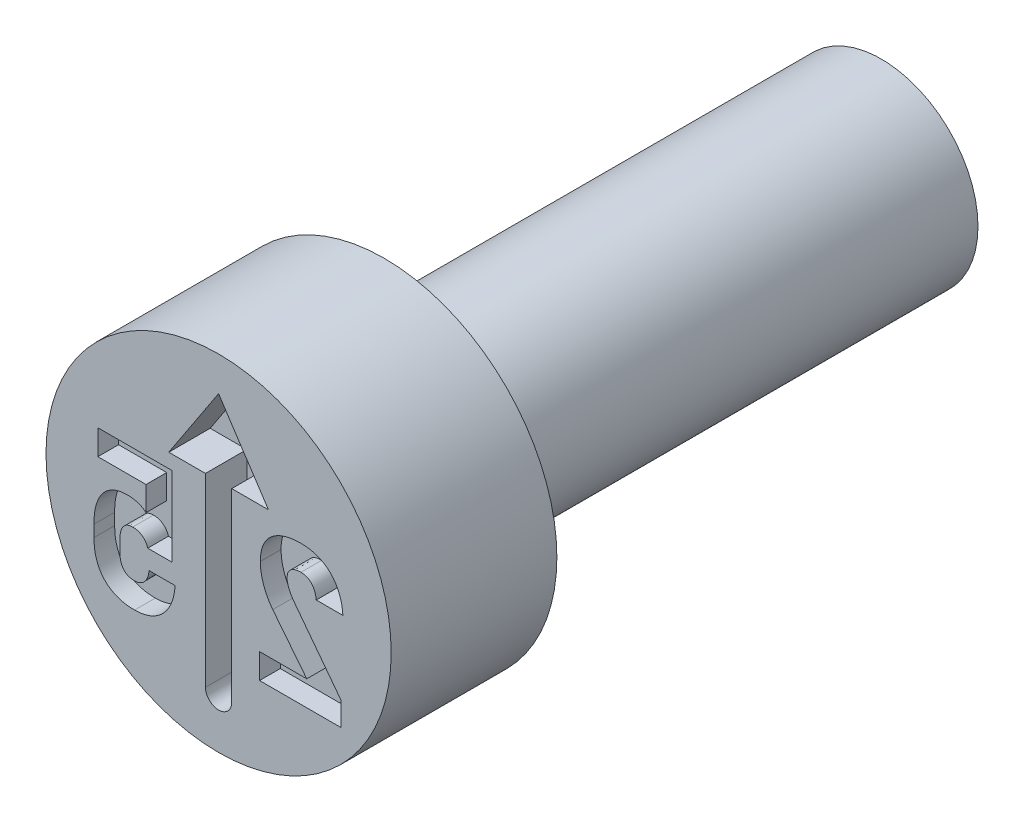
ISO-10303-21;
HEADER;
FILE_DESCRIPTION(('STEP AP214'),'2;1');
FILE_NAME('part.step','',(''),(''),'','','');
FILE_SCHEMA(('AUTOMOTIVE_DESIGN { 1 0 10303 214 1 1 1 1 }'));
ENDSEC;
DATA;
#1=APPLICATION_CONTEXT('core data for automotive mechanical design processes');
#2=APPLICATION_PROTOCOL_DEFINITION('international standard','automotive_design',2000,#1);
#3=PRODUCT_CONTEXT('',#1,'mechanical');
#4=PRODUCT('Part','Part','',(#3));
#5=PRODUCT_RELATED_PRODUCT_CATEGORY('part','',(#4));
#6=PRODUCT_DEFINITION_FORMATION('','',#4);
#7=PRODUCT_DEFINITION_CONTEXT('part definition',#1,'design');
#8=PRODUCT_DEFINITION('design','',#6,#7);
#9=PRODUCT_DEFINITION_SHAPE('','',#8);
#10=(LENGTH_UNIT() NAMED_UNIT(*) SI_UNIT(.MILLI.,.METRE.));
#11=(NAMED_UNIT(*) PLANE_ANGLE_UNIT() SI_UNIT($,.RADIAN.));
#12=(NAMED_UNIT(*) SI_UNIT($,.STERADIAN.) SOLID_ANGLE_UNIT());
#13=UNCERTAINTY_MEASURE_WITH_UNIT(LENGTH_MEASURE(1.E-05),#10,'distance_accuracy_value','');
#14=(GEOMETRIC_REPRESENTATION_CONTEXT(3) GLOBAL_UNCERTAINTY_ASSIGNED_CONTEXT((#13)) GLOBAL_UNIT_ASSIGNED_CONTEXT((#10,
#11,#12)) REPRESENTATION_CONTEXT('',''));
#15=CARTESIAN_POINT('',(0.,0.,0.));
#16=DIRECTION('',(0.,0.,1.));
#17=DIRECTION('',(1.,0.,0.));
#18=AXIS2_PLACEMENT_3D('',#15,#16,#17);
#19=CARTESIAN_POINT('',(0.,0.699999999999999,-1.2));
#20=DIRECTION('',(0.,0.,1.));
#21=DIRECTION('',(1.,0.,0.));
#22=AXIS2_PLACEMENT_3D('',#19,#20,#21);
#23=PLANE('',#22);
#24=CARTESIAN_POINT('',(0.,0.,-1.2));
#25=DIRECTION('',(0.,0.,1.));
#26=DIRECTION('',(1.,0.,0.));
#27=AXIS2_PLACEMENT_3D('',#24,#25,#26);
#28=CIRCLE('',#27,1.25);
#29=CARTESIAN_POINT('',(1.25,0.,-1.2));
#30=VERTEX_POINT('',#29);
#31=EDGE_CURVE('E11',#30,#30,#28,.T.);
#32=ORIENTED_EDGE('',*,*,#31,.F.);
#33=EDGE_LOOP('',(#32));
#34=FACE_BOUND('',#33,.T.);
#35=CARTESIAN_POINT('',(0.,0.,-1.2));
#36=DIRECTION('',(0.,0.,1.));
#37=DIRECTION('',(1.,0.,0.));
#38=AXIS2_PLACEMENT_3D('',#35,#36,#37);
#39=CIRCLE('',#38,0.699999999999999);
#40=CARTESIAN_POINT('',(0.699999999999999,0.,-1.2));
#41=VERTEX_POINT('',#40);
#42=EDGE_CURVE('E562',#41,#41,#39,.T.);
#43=ORIENTED_EDGE('',*,*,#42,.T.);
#44=EDGE_LOOP('',(#43));
#45=FACE_BOUND('',#44,.T.);
#46=ADVANCED_FACE('F34',(#34,#45),#23,.F.);
#47=CARTESIAN_POINT('',(0.,0.,-0.403888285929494));
#48=DIRECTION('',(0.,0.,1.));
#49=DIRECTION('',(1.,0.,0.));
#50=AXIS2_PLACEMENT_3D('',#47,#48,#49);
#51=CYLINDRICAL_SURFACE('',#50,1.25);
#52=CARTESIAN_POINT('',(0.,0.,0.));
#53=DIRECTION('',(0.,0.,1.));
#54=DIRECTION('',(1.,0.,0.));
#55=AXIS2_PLACEMENT_3D('',#52,#53,#54);
#56=CIRCLE('',#55,1.25);
#57=CARTESIAN_POINT('',(1.25,0.,0.));
#58=VERTEX_POINT('',#57);
#59=EDGE_CURVE('E41',#58,#58,#56,.T.);
#60=ORIENTED_EDGE('',*,*,#59,.F.);
#61=EDGE_LOOP('',(#60));
#62=FACE_BOUND('',#61,.T.);
#63=ORIENTED_EDGE('',*,*,#31,.T.);
#64=EDGE_LOOP('',(#63));
#65=FACE_BOUND('',#64,.T.);
#66=ADVANCED_FACE('F584',(#62,#65),#51,.T.);
#67=CARTESIAN_POINT('',(0.,1.25,0.));
#68=DIRECTION('',(0.,0.,-1.));
#69=DIRECTION('',(-1.,0.,0.));
#70=AXIS2_PLACEMENT_3D('',#67,#68,#69);
#71=PLANE('',#70);
#72=CARTESIAN_POINT('',(-0.608203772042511,-0.66039331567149,0.));
#73=CARTESIAN_POINT('',(-0.595060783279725,-0.65999234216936,0.));
#74=CARTESIAN_POINT('',(-0.569342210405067,-0.659207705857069,0.));
#75=CARTESIAN_POINT('',(-0.531853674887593,-0.652163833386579,0.));
#76=CARTESIAN_POINT('',(-0.49631332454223,-0.641255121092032,0.));
#77=CARTESIAN_POINT('',(-0.462985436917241,-0.625693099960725,0.));
#78=CARTESIAN_POINT('',(-0.432232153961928,-0.605922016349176,0.));
#79=CARTESIAN_POINT('',(-0.404733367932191,-0.581745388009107,0.));
#80=CARTESIAN_POINT('',(-0.38023685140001,-0.553796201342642,0.));
#81=CARTESIAN_POINT('',(-0.359233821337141,-0.521829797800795,0.));
#82=CARTESIAN_POINT('',(-0.341936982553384,-0.486188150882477,0.));
#83=CARTESIAN_POINT('',(-0.32847109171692,-0.447291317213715,0.));
#84=CARTESIAN_POINT('',(-0.319222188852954,-0.405209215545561,0.));
#85=CARTESIAN_POINT('',(-0.316533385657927,-0.376013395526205,0.));
#86=CARTESIAN_POINT('',(-0.315153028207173,-0.361025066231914,0.));
#87=B_SPLINE_CURVE_WITH_KNOTS('',3,(#72,#73,#74,#75,#76,#77,#78,#79,#80,#81,#82,#83,#84,#85,
#86),.UNSPECIFIED.,.F.,.F.,(4,1,1,1,1,1,1,1,1,1,1,1,4),(0.,0.0844304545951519,0.165215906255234,
0.244369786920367,0.322918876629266,0.400936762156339,0.478631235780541,0.557558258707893,
0.63920335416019,0.723781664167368,0.811629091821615,0.903295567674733,1.),.UNSPECIFIED.);
#88=CARTESIAN_POINT('',(-0.608203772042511,-0.66039331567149,0.));
#89=VERTEX_POINT('',#88);
#90=CARTESIAN_POINT('',(-0.315153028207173,-0.361025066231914,0.));
#91=VERTEX_POINT('',#90);
#92=EDGE_CURVE('E856',#89,#91,#87,.T.);
#93=ORIENTED_EDGE('',*,*,#92,.F.);
#94=CARTESIAN_POINT('',(-0.903088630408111,-0.3534848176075,0.));
#95=CARTESIAN_POINT('',(-0.902642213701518,-0.36905951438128,0.));
#96=CARTESIAN_POINT('',(-0.901778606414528,-0.399189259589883,0.));
#97=CARTESIAN_POINT('',(-0.895602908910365,-0.442759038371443,0.));
#98=CARTESIAN_POINT('',(-0.884469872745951,-0.48272521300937,0.));
#99=CARTESIAN_POINT('',(-0.869553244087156,-0.519346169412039,0.));
#100=CARTESIAN_POINT('',(-0.850075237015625,-0.551894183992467,0.));
#101=CARTESIAN_POINT('',(-0.82675147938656,-0.58064420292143,0.));
#102=CARTESIAN_POINT('',(-0.799156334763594,-0.604932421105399,0.));
#103=CARTESIAN_POINT('',(-0.767941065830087,-0.625373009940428,0.));
#104=CARTESIAN_POINT('',(-0.732808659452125,-0.641049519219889,0.));
#105=CARTESIAN_POINT('',(-0.694320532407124,-0.652437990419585,0.));
#106=CARTESIAN_POINT('',(-0.652324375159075,-0.659211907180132,0.));
#107=CARTESIAN_POINT('',(-0.623241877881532,-0.659990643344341,0.));
#108=CARTESIAN_POINT('',(-0.608203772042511,-0.66039331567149,0.));
#109=B_SPLINE_CURVE_WITH_KNOTS('',3,(#94,#95,#96,#97,#98,#99,#100,#101,#102,#103,#104,#105,#106,
#107,#108),.UNSPECIFIED.,.F.,.F.,(4,1,1,1,1,1,1,1,1,1,1,1,4),(0.,0.0965919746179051,
0.1868602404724,0.272108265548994,0.353324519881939,0.431359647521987,0.506505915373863,
0.582010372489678,0.658435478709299,0.737063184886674,0.819709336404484,0.906774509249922,1.),.UNSPECIFIED.);
#110=CARTESIAN_POINT('',(-0.903088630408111,-0.353484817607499,0.));
#111=VERTEX_POINT('',#110);
#112=EDGE_CURVE('E48',#111,#89,#109,.T.);
#113=ORIENTED_EDGE('',*,*,#112,.F.);
#114=DIRECTION('',(0.,-1.,0.));
#115=VECTOR('',#114,1.);
#116=CARTESIAN_POINT('',(-0.903088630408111,-0.269726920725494,0.));
#117=LINE('',#116,#115);
#118=CARTESIAN_POINT('',(-0.903088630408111,-0.269726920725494,0.));
#119=VERTEX_POINT('',#118);
#120=EDGE_CURVE('E329',#119,#111,#117,.T.);
#121=ORIENTED_EDGE('',*,*,#120,.F.);
#122=CARTESIAN_POINT('',(-0.656909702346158,0.0363664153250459,0.));
#123=CARTESIAN_POINT('',(-0.669442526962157,0.0359696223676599,0.));
#124=CARTESIAN_POINT('',(-0.693749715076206,0.035200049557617,0.));
#125=CARTESIAN_POINT('',(-0.728810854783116,0.0282775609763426,0.));
#126=CARTESIAN_POINT('',(-0.761122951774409,0.0171870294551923,0.));
#127=CARTESIAN_POINT('',(-0.790419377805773,0.00120878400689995,0.));
#128=CARTESIAN_POINT('',(-0.816733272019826,-0.0188175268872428,0.));
#129=CARTESIAN_POINT('',(-0.839588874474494,-0.0432880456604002,0.));
#130=CARTESIAN_POINT('',(-0.859128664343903,-0.0718039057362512,0.));
#131=CARTESIAN_POINT('',(-0.875120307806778,-0.104384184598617,0.));
#132=CARTESIAN_POINT('',(-0.88770640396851,-0.140743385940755,0.));
#133=CARTESIAN_POINT('',(-0.89684806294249,-0.180627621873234,0.));
#134=CARTESIAN_POINT('',(-0.902057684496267,-0.224075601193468,0.));
#135=CARTESIAN_POINT('',(-0.90273700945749,-0.254156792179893,0.));
#136=CARTESIAN_POINT('',(-0.903088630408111,-0.269726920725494,0.));
#137=B_SPLINE_CURVE_WITH_KNOTS('',3,(#122,#123,#124,#125,#126,#127,#128,#129,#130,#131,#132,
#133,#134,#135,#136),.UNSPECIFIED.,.F.,.F.,(4,1,1,1,1,1,1,1,1,1,1,1,4),(0.,0.084394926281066,
0.163682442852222,0.239848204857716,0.313806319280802,0.3876154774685,0.461788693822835,
0.538496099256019,0.61978489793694,0.70565234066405,0.797279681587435,0.895071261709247,1.),.UNSPECIFIED.);
#138=CARTESIAN_POINT('',(-0.656909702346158,0.0363664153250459,0.));
#139=VERTEX_POINT('',#138);
#140=EDGE_CURVE('E332',#139,#119,#137,.T.);
#141=ORIENTED_EDGE('',*,*,#140,.F.);
#142=CARTESIAN_POINT('',(-0.52566861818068,-0.00826370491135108,0.));
#143=CARTESIAN_POINT('',(-0.52946262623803,-0.00490420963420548,0.));
#144=CARTESIAN_POINT('',(-0.537267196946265,0.00200653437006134,0.));
#145=CARTESIAN_POINT('',(-0.550911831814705,0.010781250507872,0.));
#146=CARTESIAN_POINT('',(-0.5665171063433,0.0182339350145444,0.));
#147=CARTESIAN_POINT('',(-0.589544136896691,0.0268174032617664,0.));
#148=CARTESIAN_POINT('',(-0.61983520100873,0.0344501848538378,0.));
#149=CARTESIAN_POINT('',(-0.644702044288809,0.0357354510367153,0.));
#150=CARTESIAN_POINT('',(-0.656909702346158,0.0363664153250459,0.));
#151=B_SPLINE_CURVE_WITH_KNOTS('',3,(#142,#143,#144,#145,#146,#147,#148,#149,#150),
.UNSPECIFIED.,.F.,.F.,(4,1,1,1,1,1,4),(0.,0.107291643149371,0.220707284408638,0.342410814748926,
0.47317918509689,0.74137254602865,1.),.UNSPECIFIED.);
#152=CARTESIAN_POINT('',(-0.52566861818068,-0.00826370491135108,0.));
#153=VERTEX_POINT('',#152);
#154=EDGE_CURVE('E783',#153,#139,#151,.T.);
#155=ORIENTED_EDGE('',*,*,#154,.F.);
#156=DIRECTION('',(0.,-1.,0.));
#157=VECTOR('',#156,1.);
#158=CARTESIAN_POINT('',(-0.52566861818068,0.168422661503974,0.));
#159=LINE('',#158,#157);
#160=CARTESIAN_POINT('',(-0.52566861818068,0.168422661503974,0.));
#161=VERTEX_POINT('',#160);
#162=EDGE_CURVE('E791',#161,#153,#159,.T.);
#163=ORIENTED_EDGE('',*,*,#162,.F.);
#164=DIRECTION('',(1.,0.,0.));
#165=VECTOR('',#164,1.);
#166=CARTESIAN_POINT('',(-0.874354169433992,0.168422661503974,0.));
#167=LINE('',#166,#165);
#168=CARTESIAN_POINT('',(-0.874354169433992,0.168422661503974,0.));
#169=VERTEX_POINT('',#168);
#170=EDGE_CURVE('E797',#169,#161,#167,.T.);
#171=ORIENTED_EDGE('',*,*,#170,.F.);
#172=DIRECTION('',(0.,-1.,0.));
#173=VECTOR('',#172,1.);
#174=CARTESIAN_POINT('',(-0.874354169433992,0.35,0.));
#175=LINE('',#174,#173);
#176=CARTESIAN_POINT('',(-0.874354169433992,0.35,0.));
#177=VERTEX_POINT('',#176);
#178=EDGE_CURVE('E800',#177,#169,#175,.T.);
#179=ORIENTED_EDGE('',*,*,#178,.F.);
#180=DIRECTION('',(-1.,0.,0.));
#181=VECTOR('',#180,1.);
#182=CARTESIAN_POINT('',(-0.337162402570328,0.35,0.));
#183=LINE('',#182,#181);
#184=CARTESIAN_POINT('',(-0.337162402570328,0.35,0.));
#185=VERTEX_POINT('',#184);
#186=EDGE_CURVE('E803',#185,#177,#183,.T.);
#187=ORIENTED_EDGE('',*,*,#186,.F.);
#188=DIRECTION('',(0.,1.,0.));
#189=VECTOR('',#188,1.);
#190=CARTESIAN_POINT('',(-0.337162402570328,-0.224893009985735,0.));
#191=LINE('',#190,#189);
#192=CARTESIAN_POINT('',(-0.337162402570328,-0.224893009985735,0.));
#193=VERTEX_POINT('',#192);
#194=EDGE_CURVE('E806',#193,#185,#191,.T.);
#195=ORIENTED_EDGE('',*,*,#194,.F.);
#196=DIRECTION('',(1.,0.,0.));
#197=VECTOR('',#196,1.);
#198=CARTESIAN_POINT('',(-0.513237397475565,-0.224893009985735,0.));
#199=LINE('',#198,#197);
#200=CARTESIAN_POINT('',(-0.513237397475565,-0.224893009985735,0.));
#201=VERTEX_POINT('',#200);
#202=EDGE_CURVE('E809',#201,#193,#199,.T.);
#203=ORIENTED_EDGE('',*,*,#202,.F.);
#204=CARTESIAN_POINT('',(-0.621857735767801,-0.146433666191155,0.));
#205=CARTESIAN_POINT('',(-0.615315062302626,-0.146633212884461,0.));
#206=CARTESIAN_POINT('',(-0.602648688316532,-0.147019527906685,0.));
#207=CARTESIAN_POINT('',(-0.584411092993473,-0.151019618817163,0.));
#208=CARTESIAN_POINT('',(-0.567648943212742,-0.157564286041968,0.));
#209=CARTESIAN_POINT('',(-0.552552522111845,-0.166817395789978,0.));
#210=CARTESIAN_POINT('',(-0.539219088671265,-0.17815821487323,0.));
#211=CARTESIAN_POINT('',(-0.528241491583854,-0.191861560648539,0.));
#212=CARTESIAN_POINT('',(-0.519039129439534,-0.207345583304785,0.));
#213=CARTESIAN_POINT('',(-0.515199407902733,-0.218958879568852,0.));
#214=CARTESIAN_POINT('',(-0.513237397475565,-0.224893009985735,0.));
#215=B_SPLINE_CURVE_WITH_KNOTS('',3,(#204,#205,#206,#207,#208,#209,#210,#211,#212,#213,#214),
.UNSPECIFIED.,.F.,.F.,(4,1,1,1,1,1,1,1,4),(0.,0.135635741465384,0.262585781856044,
0.385395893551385,0.507524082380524,0.628507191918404,0.746772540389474,0.870606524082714,1.),.UNSPECIFIED.);
#216=CARTESIAN_POINT('',(-0.621857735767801,-0.146433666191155,0.));
#217=VERTEX_POINT('',#216);
#218=EDGE_CURVE('E812',#217,#201,#215,.T.);
#219=ORIENTED_EDGE('',*,*,#218,.F.);
#220=CARTESIAN_POINT('',(-0.714786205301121,-0.269726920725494,0.));
#221=CARTESIAN_POINT('',(-0.714584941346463,-0.26039564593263,0.));
#222=CARTESIAN_POINT('',(-0.714202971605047,-0.242686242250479,0.));
#223=CARTESIAN_POINT('',(-0.709451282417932,-0.217913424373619,0.));
#224=CARTESIAN_POINT('',(-0.70206334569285,-0.196299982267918,0.));
#225=CARTESIAN_POINT('',(-0.691152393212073,-0.178357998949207,0.));
#226=CARTESIAN_POINT('',(-0.677588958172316,-0.16387603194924,0.));
#227=CARTESIAN_POINT('',(-0.661175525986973,-0.153590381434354,0.));
#228=CARTESIAN_POINT('',(-0.642241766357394,-0.147515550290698,0.));
#229=CARTESIAN_POINT('',(-0.628832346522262,-0.146803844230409,0.));
#230=CARTESIAN_POINT('',(-0.621857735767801,-0.146433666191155,0.));
#231=B_SPLINE_CURVE_WITH_KNOTS('',3,(#220,#221,#222,#223,#224,#225,#226,#227,#228,#229,#230),
.UNSPECIFIED.,.F.,.F.,(4,1,1,1,1,1,1,1,4),(0.,0.160198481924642,0.304033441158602,
0.431843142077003,0.550810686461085,0.662316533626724,0.769888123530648,0.880312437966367,1.),.UNSPECIFIED.);
#232=CARTESIAN_POINT('',(-0.714786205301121,-0.269726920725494,0.));
#233=VERTEX_POINT('',#232);
#234=EDGE_CURVE('E817',#233,#217,#231,.T.);
#235=ORIENTED_EDGE('',*,*,#234,.F.);
#236=DIRECTION('',(0.,1.,0.));
#237=VECTOR('',#236,1.);
#238=CARTESIAN_POINT('',(-0.714786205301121,-0.353484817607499,0.));
#239=LINE('',#238,#237);
#240=CARTESIAN_POINT('',(-0.714786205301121,-0.353484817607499,0.));
#241=VERTEX_POINT('',#240);
#242=EDGE_CURVE('E825',#241,#233,#239,.T.);
#243=ORIENTED_EDGE('',*,*,#242,.F.);
#244=CARTESIAN_POINT('',(-0.610853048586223,-0.477389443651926,0.));
#245=CARTESIAN_POINT('',(-0.618712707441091,-0.477047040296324,0.));
#246=CARTESIAN_POINT('',(-0.633746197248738,-0.476392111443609,0.));
#247=CARTESIAN_POINT('',(-0.65481812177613,-0.470071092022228,0.));
#248=CARTESIAN_POINT('',(-0.673162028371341,-0.459951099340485,0.));
#249=CARTESIAN_POINT('',(-0.688314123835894,-0.445388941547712,0.));
#250=CARTESIAN_POINT('',(-0.700401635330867,-0.427244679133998,0.));
#251=CARTESIAN_POINT('',(-0.708957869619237,-0.405516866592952,0.));
#252=CARTESIAN_POINT('',(-0.714025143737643,-0.380550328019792,0.));
#253=CARTESIAN_POINT('',(-0.714523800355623,-0.362816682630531,0.));
#254=CARTESIAN_POINT('',(-0.714786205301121,-0.353484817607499,0.));
#255=B_SPLINE_CURVE_WITH_KNOTS('',3,(#244,#245,#246,#247,#248,#249,#250,#251,#252,#253,#254),
.UNSPECIFIED.,.F.,.F.,(4,1,1,1,1,1,1,1,4),(0.,0.128261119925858,0.245330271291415,
0.356275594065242,0.467886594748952,0.585607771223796,0.710231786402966,0.847517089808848,1.),.UNSPECIFIED.);
#256=CARTESIAN_POINT('',(-0.610853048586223,-0.477389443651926,0.));
#257=VERTEX_POINT('',#256);
#258=EDGE_CURVE('E831',#257,#241,#255,.T.);
#259=ORIENTED_EDGE('',*,*,#258,.F.);
#260=CARTESIAN_POINT('',(-0.503659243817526,-0.361025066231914,0.));
#261=CARTESIAN_POINT('',(-0.50473537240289,-0.369777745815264,0.));
#262=CARTESIAN_POINT('',(-0.506786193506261,-0.386458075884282,0.));
#263=CARTESIAN_POINT('',(-0.514181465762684,-0.40960562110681,0.));
#264=CARTESIAN_POINT('',(-0.523836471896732,-0.429952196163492,0.));
#265=CARTESIAN_POINT('',(-0.536589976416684,-0.447024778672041,0.));
#266=CARTESIAN_POINT('',(-0.551734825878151,-0.460885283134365,0.));
#267=CARTESIAN_POINT('',(-0.569680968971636,-0.470285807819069,0.));
#268=CARTESIAN_POINT('',(-0.589515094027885,-0.47655867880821,0.));
#269=CARTESIAN_POINT('',(-0.603601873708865,-0.477107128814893,0.));
#270=CARTESIAN_POINT('',(-0.610853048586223,-0.477389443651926,0.));
#271=B_SPLINE_CURVE_WITH_KNOTS('',3,(#260,#261,#262,#263,#264,#265,#266,#267,#268,#269,#270),
.UNSPECIFIED.,.F.,.F.,(4,1,1,1,1,1,1,1,4),(0.,0.150277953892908,0.28639068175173,
0.412971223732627,0.533144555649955,0.648163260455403,0.760273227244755,0.876600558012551,1.),.UNSPECIFIED.);
#272=CARTESIAN_POINT('',(-0.503659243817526,-0.361025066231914,0.));
#273=VERTEX_POINT('',#272);
#274=EDGE_CURVE('E836',#273,#257,#271,.T.);
#275=ORIENTED_EDGE('',*,*,#274,.F.);
#276=DIRECTION('',(0.,-1.,0.));
#277=VECTOR('',#276,1.);
#278=CARTESIAN_POINT('',(-0.503659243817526,-0.360413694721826,0.));
#279=LINE('',#278,#277);
#280=CARTESIAN_POINT('',(-0.503659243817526,-0.360413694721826,0.));
#281=VERTEX_POINT('',#280);
#282=EDGE_CURVE('E844',#281,#273,#279,.T.);
#283=ORIENTED_EDGE('',*,*,#282,.F.);
#284=DIRECTION('',(-1.,0.,0.));
#285=VECTOR('',#284,1.);
#286=CARTESIAN_POINT('',(-0.315153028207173,-0.360413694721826,0.));
#287=LINE('',#286,#285);
#288=CARTESIAN_POINT('',(-0.315153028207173,-0.360413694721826,0.));
#289=VERTEX_POINT('',#288);
#290=EDGE_CURVE('E850',#289,#281,#287,.T.);
#291=ORIENTED_EDGE('',*,*,#290,.F.);
#292=DIRECTION('',(0.,1.,0.));
#293=VECTOR('',#292,1.);
#294=CARTESIAN_POINT('',(-0.315153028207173,-0.361025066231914,0.));
#295=LINE('',#294,#293);
#296=EDGE_CURVE('E853',#91,#289,#295,.T.);
#297=ORIENTED_EDGE('',*,*,#296,.F.);
#298=EDGE_LOOP('',(#93,#113,#121,#141,#155,#163,#171,#179,#187,#195,#203,#219,#235,#243,#259,
#275,#283,#291,#297));
#299=FACE_BOUND('',#298,.T.);
#300=DIRECTION('',(-0.60539313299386,0.795926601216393,0.));
#301=VECTOR('',#300,1.);
#302=CARTESIAN_POINT('',(0.888107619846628,-0.480038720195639,0.));
#303=LINE('',#302,#301);
#304=CARTESIAN_POINT('',(0.888107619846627,-0.480038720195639,0.));
#305=VERTEX_POINT('',#304);
#306=CARTESIAN_POINT('',(0.544924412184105,-0.028846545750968,0.));
#307=VERTEX_POINT('',#306);
#308=EDGE_CURVE('E405',#305,#307,#303,.T.);
#309=ORIENTED_EDGE('',*,*,#308,.F.);
#310=DIRECTION('',(0.,1.,0.));
#311=VECTOR('',#310,1.);
#312=CARTESIAN_POINT('',(0.888107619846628,-0.65,0.));
#313=LINE('',#312,#311);
#314=CARTESIAN_POINT('',(0.888107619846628,-0.65,0.));
#315=VERTEX_POINT('',#314);
#316=EDGE_CURVE('E56',#315,#305,#313,.T.);
#317=ORIENTED_EDGE('',*,*,#316,.F.);
#318=DIRECTION('',(1.,0.,0.));
#319=VECTOR('',#318,1.);
#320=CARTESIAN_POINT('',(0.296707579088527,-0.65,0.));
#321=LINE('',#320,#319);
#322=CARTESIAN_POINT('',(0.296707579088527,-0.65,0.));
#323=VERTEX_POINT('',#322);
#324=EDGE_CURVE('E481',#323,#315,#321,.T.);
#325=ORIENTED_EDGE('',*,*,#324,.F.);
#326=DIRECTION('',(0.,-1.,0.));
#327=VECTOR('',#326,1.);
#328=CARTESIAN_POINT('',(0.296707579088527,-0.468422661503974,0.));
#329=LINE('',#328,#327);
#330=CARTESIAN_POINT('',(0.296707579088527,-0.468422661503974,0.));
#331=VERTEX_POINT('',#330);
#332=EDGE_CURVE('E478',#331,#323,#329,.T.);
#333=ORIENTED_EDGE('',*,*,#332,.F.);
#334=DIRECTION('',(-1.,0.,0.));
#335=VECTOR('',#334,1.);
#336=CARTESIAN_POINT('',(0.638464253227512,-0.468422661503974,0.));
#337=LINE('',#336,#335);
#338=CARTESIAN_POINT('',(0.638464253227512,-0.468422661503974,0.));
#339=VERTEX_POINT('',#338);
#340=EDGE_CURVE('E475',#339,#331,#337,.T.);
#341=ORIENTED_EDGE('',*,*,#340,.F.);
#342=DIRECTION('',(0.620676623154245,-0.78406666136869,0.));
#343=VECTOR('',#342,1.);
#344=CARTESIAN_POINT('',(0.39228532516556,-0.157438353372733,0.));
#345=LINE('',#344,#343);
#346=CARTESIAN_POINT('',(0.39228532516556,-0.157438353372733,0.));
#347=VERTEX_POINT('',#346);
#348=EDGE_CURVE('E469',#347,#339,#345,.T.);
#349=ORIENTED_EDGE('',*,*,#348,.F.);
#350=CARTESIAN_POINT('',(0.302209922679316,0.0989300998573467,0.));
#351=CARTESIAN_POINT('',(0.302471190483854,0.0875714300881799,0.));
#352=CARTESIAN_POINT('',(0.302994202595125,0.0648333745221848,0.));
#353=CARTESIAN_POINT('',(0.307658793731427,0.0308634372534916,0.));
#354=CARTESIAN_POINT('',(0.315286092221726,-0.00291022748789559,0.));
#355=CARTESIAN_POINT('',(0.325635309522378,-0.0363692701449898,0.));
#356=CARTESIAN_POINT('',(0.338558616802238,-0.0689549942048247,0.));
#357=CARTESIAN_POINT('',(0.353981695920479,-0.100148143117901,0.));
#358=CARTESIAN_POINT('',(0.37159019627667,-0.129869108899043,0.));
#359=CARTESIAN_POINT('',(0.385387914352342,-0.148249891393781,0.));
#360=CARTESIAN_POINT('',(0.39228532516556,-0.157438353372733,0.));
#361=B_SPLINE_CURVE_WITH_KNOTS('',3,(#350,#351,#352,#353,#354,#355,#356,#357,#358,#359,#360),
.UNSPECIFIED.,.F.,.F.,(4,1,1,1,1,1,1,1,4),(0.,0.123148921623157,0.24652244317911,
0.371108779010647,0.498350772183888,0.625999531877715,0.750879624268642,0.875465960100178,1.),.UNSPECIFIED.);
#362=CARTESIAN_POINT('',(0.302209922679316,0.0989300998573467,0.));
#363=VERTEX_POINT('',#362);
#364=EDGE_CURVE('E464',#363,#347,#361,.T.);
#365=ORIENTED_EDGE('',*,*,#364,.F.);
#366=DIRECTION('',(0.,-1.,0.));
#367=VECTOR('',#366,1.);
#368=CARTESIAN_POINT('',(0.302209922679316,0.0997452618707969,0.));
#369=LINE('',#368,#367);
#370=CARTESIAN_POINT('',(0.302209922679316,0.0997452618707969,0.));
#371=VERTEX_POINT('',#370);
#372=EDGE_CURVE('E458',#371,#363,#369,.T.);
#373=ORIENTED_EDGE('',*,*,#372,.F.);
#374=CARTESIAN_POINT('',(0.597909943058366,0.36039331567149,0.));
#375=CARTESIAN_POINT('',(0.582878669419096,0.360079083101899,0.));
#376=CARTESIAN_POINT('',(0.553786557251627,0.359470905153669,0.));
#377=CARTESIAN_POINT('',(0.511895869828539,0.353745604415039,0.));
#378=CARTESIAN_POINT('',(0.473376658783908,0.344218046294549,0.));
#379=CARTESIAN_POINT('',(0.438325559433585,0.33083220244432,0.));
#380=CARTESIAN_POINT('',(0.406972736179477,0.313625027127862,0.));
#381=CARTESIAN_POINT('',(0.379173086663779,0.293200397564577,0.));
#382=CARTESIAN_POINT('',(0.355711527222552,0.268765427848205,0.));
#383=CARTESIAN_POINT('',(0.336196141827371,0.241006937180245,0.));
#384=CARTESIAN_POINT('',(0.320812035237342,0.210032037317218,0.));
#385=CARTESIAN_POINT('',(0.310038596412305,0.175867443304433,0.));
#386=CARTESIAN_POINT('',(0.303440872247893,0.138787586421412,0.));
#387=CARTESIAN_POINT('',(0.302628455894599,0.113019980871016,0.));
#388=CARTESIAN_POINT('',(0.302209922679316,0.0997452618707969,0.));
#389=B_SPLINE_CURVE_WITH_KNOTS('',3,(#374,#375,#376,#377,#378,#379,#380,#381,#382,#383,#384,
#385,#386,#387,#388),.UNSPECIFIED.,.F.,.F.,(4,1,1,1,1,1,1,1,1,1,1,1,4),(0.,0.100715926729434,
0.194929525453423,0.2827284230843,0.366191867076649,0.44566981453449,0.521804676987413,
0.596515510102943,0.67168287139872,0.748455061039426,0.827368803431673,0.911065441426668,1.),.UNSPECIFIED.);
#390=CARTESIAN_POINT('',(0.597909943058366,0.36039331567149,0.));
#391=VERTEX_POINT('',#390);
#392=EDGE_CURVE('E450',#391,#371,#389,.T.);
#393=ORIENTED_EDGE('',*,*,#392,.F.);
#394=CARTESIAN_POINT('',(0.900538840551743,0.0612288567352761,0.));
#395=CARTESIAN_POINT('',(0.899154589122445,0.0762836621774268,0.));
#396=CARTESIAN_POINT('',(0.896457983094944,0.10561133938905,0.));
#397=CARTESIAN_POINT('',(0.887288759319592,0.147786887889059,0.));
#398=CARTESIAN_POINT('',(0.873743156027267,0.18659472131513,0.));
#399=CARTESIAN_POINT('',(0.856436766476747,0.222141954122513,0.));
#400=CARTESIAN_POINT('',(0.835216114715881,0.253979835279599,0.));
#401=CARTESIAN_POINT('',(0.81059384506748,0.28209978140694,0.));
#402=CARTESIAN_POINT('',(0.782297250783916,0.30595559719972,0.));
#403=CARTESIAN_POINT('',(0.750816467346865,0.325778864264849,0.));
#404=CARTESIAN_POINT('',(0.716288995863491,0.341292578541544,0.));
#405=CARTESIAN_POINT('',(0.679137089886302,0.352596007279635,0.));
#406=CARTESIAN_POINT('',(0.6393047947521,0.359112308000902,0.));
#407=CARTESIAN_POINT('',(0.61192729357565,0.359959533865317,0.));
#408=CARTESIAN_POINT('',(0.597909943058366,0.36039331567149,0.));
#409=B_SPLINE_CURVE_WITH_KNOTS('',3,(#394,#395,#396,#397,#398,#399,#400,#401,#402,#403,#404,
#405,#406,#407,#408),.UNSPECIFIED.,.F.,.F.,(4,1,1,1,1,1,1,1,1,1,1,1,4),(0.,0.0953291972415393,
0.185707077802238,0.271513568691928,0.35413169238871,0.434493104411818,0.512233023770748,
0.58917600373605,0.667186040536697,0.746219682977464,0.827302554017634,0.911578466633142,1.),.UNSPECIFIED.);
#410=CARTESIAN_POINT('',(0.900538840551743,0.0612288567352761,0.));
#411=VERTEX_POINT('',#410);
#412=EDGE_CURVE('E445',#411,#391,#409,.T.);
#413=ORIENTED_EDGE('',*,*,#412,.F.);
#414=DIRECTION('',(0.,1.,0.));
#415=VECTOR('',#414,1.);
#416=CARTESIAN_POINT('',(0.900538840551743,0.060413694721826,0.));
#417=LINE('',#416,#415);
#418=CARTESIAN_POINT('',(0.900538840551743,0.060413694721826,0.));
#419=VERTEX_POINT('',#418);
#420=EDGE_CURVE('E442',#419,#411,#417,.T.);
#421=ORIENTED_EDGE('',*,*,#420,.F.);
#422=DIRECTION('',(1.,0.,0.));
#423=VECTOR('',#422,1.);
#424=CARTESIAN_POINT('',(0.707345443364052,0.060413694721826,0.));
#425=LINE('',#424,#423);
#426=CARTESIAN_POINT('',(0.707345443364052,0.060413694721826,0.));
#427=VERTEX_POINT('',#426);
#428=EDGE_CURVE('E439',#427,#419,#425,.T.);
#429=ORIENTED_EDGE('',*,*,#428,.F.);
#430=DIRECTION('',(0.,-1.,0.));
#431=VECTOR('',#430,1.);
#432=CARTESIAN_POINT('',(0.707345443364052,0.0612288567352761,0.));
#433=LINE('',#432,#431);
#434=CARTESIAN_POINT('',(0.707345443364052,0.0612288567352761,0.));
#435=VERTEX_POINT('',#434);
#436=EDGE_CURVE('E433',#435,#427,#433,.T.);
#437=ORIENTED_EDGE('',*,*,#436,.F.);
#438=CARTESIAN_POINT('',(0.596483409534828,0.178815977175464,0.));
#439=CARTESIAN_POINT('',(0.603925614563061,0.178501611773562,0.));
#440=CARTESIAN_POINT('',(0.618368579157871,0.177891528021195,0.));
#441=CARTESIAN_POINT('',(0.63891380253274,0.172078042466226,0.));
#442=CARTESIAN_POINT('',(0.657164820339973,0.162208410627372,0.));
#443=CARTESIAN_POINT('',(0.672964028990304,0.148568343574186,0.));
#444=CARTESIAN_POINT('',(0.686220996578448,0.131409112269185,0.));
#445=CARTESIAN_POINT('',(0.695992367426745,0.110737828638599,0.));
#446=CARTESIAN_POINT('',(0.703861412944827,0.0872440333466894,0.));
#447=CARTESIAN_POINT('',(0.706144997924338,0.0701925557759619,0.));
#448=CARTESIAN_POINT('',(0.707345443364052,0.0612288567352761,0.));
#449=B_SPLINE_CURVE_WITH_KNOTS('',3,(#438,#439,#440,#441,#442,#443,#444,#445,#446,#447,#448),
.UNSPECIFIED.,.F.,.F.,(4,1,1,1,1,1,1,1,4),(0.,0.124212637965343,0.241057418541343,
0.353359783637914,0.468536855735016,0.587568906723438,0.713021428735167,0.849139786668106,1.),.UNSPECIFIED.);
#450=CARTESIAN_POINT('',(0.596483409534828,0.178815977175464,0.));
#451=VERTEX_POINT('',#450);
#452=EDGE_CURVE('E425',#451,#435,#449,.T.);
#453=ORIENTED_EDGE('',*,*,#452,.F.);
#454=CARTESIAN_POINT('',(0.496218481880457,0.0942429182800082,0.));
#455=CARTESIAN_POINT('',(0.49649197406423,0.100664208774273,0.));
#456=CARTESIAN_POINT('',(0.497013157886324,0.112901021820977,0.));
#457=CARTESIAN_POINT('',(0.502044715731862,0.130116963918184,0.));
#458=CARTESIAN_POINT('',(0.510364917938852,0.145004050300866,0.));
#459=CARTESIAN_POINT('',(0.522019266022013,0.157483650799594,0.));
#460=CARTESIAN_POINT('',(0.536843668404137,0.167074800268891,0.));
#461=CARTESIAN_POINT('',(0.554329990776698,0.174081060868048,0.));
#462=CARTESIAN_POINT('',(0.574571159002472,0.178045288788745,0.));
#463=CARTESIAN_POINT('',(0.588925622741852,0.178550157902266,0.));
#464=CARTESIAN_POINT('',(0.596483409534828,0.178815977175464,0.));
#465=B_SPLINE_CURVE_WITH_KNOTS('',3,(#454,#455,#456,#457,#458,#459,#460,#461,#462,#463,#464),
.UNSPECIFIED.,.F.,.F.,(4,1,1,1,1,1,1,1,4),(0.,0.129170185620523,0.246154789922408,
0.357734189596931,0.470108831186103,0.586692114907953,0.710769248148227,0.847716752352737,1.),.UNSPECIFIED.);
#466=CARTESIAN_POINT('',(0.496218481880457,0.0942429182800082,0.));
#467=VERTEX_POINT('',#466);
#468=EDGE_CURVE('E420',#467,#451,#465,.T.);
#469=ORIENTED_EDGE('',*,*,#468,.F.);
#470=DIRECTION('',(0.,1.,0.));
#471=VECTOR('',#470,1.);
#472=CARTESIAN_POINT('',(0.496218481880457,0.0928163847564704,0.));
#473=LINE('',#472,#471);
#474=CARTESIAN_POINT('',(0.496218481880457,0.0928163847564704,0.));
#475=VERTEX_POINT('',#474);
#476=EDGE_CURVE('E414',#475,#467,#473,.T.);
#477=ORIENTED_EDGE('',*,*,#476,.F.);
#478=CARTESIAN_POINT('',(0.544924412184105,-0.028846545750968,0.));
#479=CARTESIAN_POINT('',(0.537726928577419,-0.0188607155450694,0.));
#480=CARTESIAN_POINT('',(0.523675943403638,0.000633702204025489,0.));
#481=CARTESIAN_POINT('',(0.511104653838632,0.0275219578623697,0.));
#482=CARTESIAN_POINT('',(0.503118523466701,0.0486051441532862,0.));
#483=CARTESIAN_POINT('',(0.499426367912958,0.063898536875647,0.));
#484=CARTESIAN_POINT('',(0.496693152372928,0.0785224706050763,0.));
#485=CARTESIAN_POINT('',(0.496374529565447,0.088117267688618,0.));
#486=CARTESIAN_POINT('',(0.496218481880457,0.0928163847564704,0.));
#487=B_SPLINE_CURVE_WITH_KNOTS('',3,(#478,#479,#480,#481,#482,#483,#484,#485,#486),
.UNSPECIFIED.,.F.,.F.,(4,1,1,1,1,1,4),(0.,0.27673722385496,0.540248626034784,0.66563356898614,
0.784034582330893,0.894229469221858,1.),.UNSPECIFIED.);
#488=EDGE_CURVE('E409',#307,#475,#487,.T.);
#489=ORIENTED_EDGE('',*,*,#488,.F.);
#490=EDGE_LOOP('',(#309,#317,#325,#333,#341,#349,#365,#373,#393,#413,#421,#429,#437,#453,#469,
#477,#489));
#491=FACE_BOUND('',#490,.T.);
#492=DIRECTION('',(0.,1.,0.));
#493=VECTOR('',#492,1.);
#494=CARTESIAN_POINT('',(0.0952365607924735,0.453175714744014,0.));
#495=LINE('',#494,#493);
#496=CARTESIAN_POINT('',(0.0952365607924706,-0.888080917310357,0.));
#497=VERTEX_POINT('',#496);
#498=CARTESIAN_POINT('',(0.0952365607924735,0.453175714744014,0.));
#499=VERTEX_POINT('',#498);
#500=EDGE_CURVE('E543',#497,#499,#495,.T.);
#501=ORIENTED_EDGE('',*,*,#500,.F.);
#502=CARTESIAN_POINT('',(0.,-0.888080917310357,0.));
#503=DIRECTION('',(0.,0.,1.));
#504=DIRECTION('',(1.,0.,0.));
#505=AXIS2_PLACEMENT_3D('',#502,#503,#504);
#506=CIRCLE('',#505,0.0952365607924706);
#507=CARTESIAN_POINT('',(-0.0952365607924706,-0.888080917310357,0.));
#508=VERTEX_POINT('',#507);
#509=EDGE_CURVE('E487',#508,#497,#506,.T.);
#510=ORIENTED_EDGE('',*,*,#509,.F.);
#511=DIRECTION('',(0.,-1.,0.));
#512=VECTOR('',#511,1.);
#513=CARTESIAN_POINT('',(-0.0952365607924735,0.453175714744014,0.));
#514=LINE('',#513,#512);
#515=CARTESIAN_POINT('',(-0.0952365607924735,0.453175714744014,0.));
#516=VERTEX_POINT('',#515);
#517=EDGE_CURVE('E523',#516,#508,#514,.T.);
#518=ORIENTED_EDGE('',*,*,#517,.F.);
#519=DIRECTION('',(1.,0.,0.));
#520=VECTOR('',#519,1.);
#521=CARTESIAN_POINT('',(-0.360958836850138,0.453175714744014,0.));
#522=LINE('',#521,#520);
#523=CARTESIAN_POINT('',(-0.360958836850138,0.453175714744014,0.));
#524=VERTEX_POINT('',#523);
#525=EDGE_CURVE('E555',#524,#516,#522,.T.);
#526=ORIENTED_EDGE('',*,*,#525,.F.);
#527=DIRECTION('',(-0.550159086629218,-0.835059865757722,0.));
#528=VECTOR('',#527,1.);
#529=CARTESIAN_POINT('',(0.,1.00105767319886,0.));
#530=LINE('',#529,#528);
#531=CARTESIAN_POINT('',(0.,1.00105767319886,0.));
#532=VERTEX_POINT('',#531);
#533=EDGE_CURVE('E552',#532,#524,#530,.T.);
#534=ORIENTED_EDGE('',*,*,#533,.F.);
#535=DIRECTION('',(-0.550159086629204,0.835059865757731,0.));
#536=VECTOR('',#535,1.);
#537=CARTESIAN_POINT('',(0.,1.00105767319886,0.));
#538=LINE('',#537,#536);
#539=CARTESIAN_POINT('',(0.360958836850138,0.453175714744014,0.));
#540=VERTEX_POINT('',#539);
#541=EDGE_CURVE('E549',#540,#532,#538,.T.);
#542=ORIENTED_EDGE('',*,*,#541,.F.);
#543=DIRECTION('',(1.,0.,0.));
#544=VECTOR('',#543,1.);
#545=CARTESIAN_POINT('',(0.360958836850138,0.453175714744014,0.));
#546=LINE('',#545,#544);
#547=EDGE_CURVE('E546',#499,#540,#546,.T.);
#548=ORIENTED_EDGE('',*,*,#547,.F.);
#549=EDGE_LOOP('',(#501,#510,#518,#526,#534,#542,#548));
#550=FACE_BOUND('',#549,.T.);
#551=ORIENTED_EDGE('',*,*,#59,.T.);
#552=EDGE_LOOP('',(#551));
#553=FACE_BOUND('',#552,.T.);
#554=ADVANCED_FACE('F582',(#299,#491,#550,#553),#71,.F.);
#555=CARTESIAN_POINT('',(0.,0.,-4.8));
#556=DIRECTION('',(0.,0.,1.));
#557=DIRECTION('',(1.,0.,0.));
#558=AXIS2_PLACEMENT_3D('',#555,#556,#557);
#559=PLANE('',#558);
#560=CARTESIAN_POINT('',(0.,0.,-4.8));
#561=DIRECTION('',(0.,0.,1.));
#562=DIRECTION('',(1.,0.,0.));
#563=AXIS2_PLACEMENT_3D('',#560,#561,#562);
#564=CIRCLE('',#563,0.699999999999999);
#565=CARTESIAN_POINT('',(0.699999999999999,0.,-4.8));
#566=VERTEX_POINT('',#565);
#567=EDGE_CURVE('E577',#566,#566,#564,.T.);
#568=ORIENTED_EDGE('',*,*,#567,.F.);
#569=EDGE_LOOP('',(#568));
#570=FACE_BOUND('',#569,.T.);
#571=ADVANCED_FACE('F597',(#570),#559,.F.);
#572=CARTESIAN_POINT('',(0.,0.,-0.403888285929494));
#573=DIRECTION('',(0.,0.,1.));
#574=DIRECTION('',(1.,0.,0.));
#575=AXIS2_PLACEMENT_3D('',#572,#573,#574);
#576=CYLINDRICAL_SURFACE('',#575,0.699999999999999);
#577=ORIENTED_EDGE('',*,*,#42,.F.);
#578=EDGE_LOOP('',(#577));
#579=FACE_BOUND('',#578,.T.);
#580=ORIENTED_EDGE('',*,*,#567,.T.);
#581=EDGE_LOOP('',(#580));
#582=FACE_BOUND('',#581,.T.);
#583=ADVANCED_FACE('F593',(#579,#582),#576,.T.);
#584=CARTESIAN_POINT('',(0.,-0.888080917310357,-0.3));
#585=DIRECTION('',(0.,0.,1.));
#586=DIRECTION('',(1.,0.,0.));
#587=AXIS2_PLACEMENT_3D('',#584,#585,#586);
#588=CYLINDRICAL_SURFACE('',#587,0.0952365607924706);
#589=ORIENTED_EDGE('',*,*,#509,.T.);
#590=DIRECTION('',(0.,0.,1.));
#591=VECTOR('',#590,1.);
#592=CARTESIAN_POINT('',(0.0952365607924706,-0.888080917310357,-0.3));
#593=LINE('',#592,#591);
#594=CARTESIAN_POINT('',(0.0952365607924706,-0.888080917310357,-0.3));
#595=VERTEX_POINT('',#594);
#596=EDGE_CURVE('E541',#595,#497,#593,.T.);
#597=ORIENTED_EDGE('',*,*,#596,.F.);
#598=CARTESIAN_POINT('',(0.,-0.888080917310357,-0.3));
#599=DIRECTION('',(0.,0.,1.));
#600=DIRECTION('',(1.,0.,0.));
#601=AXIS2_PLACEMENT_3D('',#598,#599,#600);
#602=CIRCLE('',#601,0.0952365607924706);
#603=CARTESIAN_POINT('',(-0.0952365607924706,-0.888080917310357,-0.3));
#604=VERTEX_POINT('',#603);
#605=EDGE_CURVE('E519',#604,#595,#602,.T.);
#606=ORIENTED_EDGE('',*,*,#605,.F.);
#607=DIRECTION('',(0.,0.,1.));
#608=VECTOR('',#607,1.);
#609=CARTESIAN_POINT('',(-0.0952365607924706,-0.888080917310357,-0.3));
#610=LINE('',#609,#608);
#611=EDGE_CURVE('E560',#604,#508,#610,.T.);
#612=ORIENTED_EDGE('',*,*,#611,.T.);
#613=EDGE_LOOP('',(#589,#597,#606,#612));
#614=FACE_BOUND('',#613,.T.);
#615=ADVANCED_FACE('F596',(#614),#588,.F.);
#616=CARTESIAN_POINT('',(-0.0952365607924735,0.453175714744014,-0.3));
#617=DIRECTION('',(-1.,0.,0.));
#618=DIRECTION('',(0.,-1.,0.));
#619=AXIS2_PLACEMENT_3D('',#616,#617,#618);
#620=PLANE('',#619);
#621=ORIENTED_EDGE('',*,*,#517,.T.);
#622=ORIENTED_EDGE('',*,*,#611,.F.);
#623=DIRECTION('',(0.,-1.,0.));
#624=VECTOR('',#623,1.);
#625=CARTESIAN_POINT('',(-0.0952365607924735,0.453175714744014,-0.3));
#626=LINE('',#625,#624);
#627=CARTESIAN_POINT('',(-0.0952365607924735,0.453175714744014,-0.3));
#628=VERTEX_POINT('',#627);
#629=EDGE_CURVE('E538',#628,#604,#626,.T.);
#630=ORIENTED_EDGE('',*,*,#629,.F.);
#631=DIRECTION('',(0.,0.,1.));
#632=VECTOR('',#631,1.);
#633=CARTESIAN_POINT('',(-0.0952365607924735,0.453175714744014,-0.3));
#634=LINE('',#633,#632);
#635=EDGE_CURVE('E563',#628,#516,#634,.T.);
#636=ORIENTED_EDGE('',*,*,#635,.T.);
#637=EDGE_LOOP('',(#621,#622,#630,#636));
#638=FACE_BOUND('',#637,.T.);
#639=ADVANCED_FACE('F611',(#638),#620,.F.);
#640=CARTESIAN_POINT('',(-0.360958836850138,0.453175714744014,-0.3));
#641=DIRECTION('',(0.,-1.,0.));
#642=DIRECTION('',(0.,0.,-1.));
#643=AXIS2_PLACEMENT_3D('',#640,#641,#642);
#644=PLANE('',#643);
#645=ORIENTED_EDGE('',*,*,#525,.T.);
#646=ORIENTED_EDGE('',*,*,#635,.F.);
#647=DIRECTION('',(1.,0.,0.));
#648=VECTOR('',#647,1.);
#649=CARTESIAN_POINT('',(-0.360958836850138,0.453175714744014,-0.3));
#650=LINE('',#649,#648);
#651=CARTESIAN_POINT('',(-0.360958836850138,0.453175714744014,-0.3));
#652=VERTEX_POINT('',#651);
#653=EDGE_CURVE('E535',#652,#628,#650,.T.);
#654=ORIENTED_EDGE('',*,*,#653,.F.);
#655=DIRECTION('',(0.,0.,1.));
#656=VECTOR('',#655,1.);
#657=CARTESIAN_POINT('',(-0.360958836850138,0.453175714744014,-0.3));
#658=LINE('',#657,#656);
#659=EDGE_CURVE('E565',#652,#524,#658,.T.);
#660=ORIENTED_EDGE('',*,*,#659,.T.);
#661=EDGE_LOOP('',(#645,#646,#654,#660));
#662=FACE_BOUND('',#661,.T.);
#663=ADVANCED_FACE('F629',(#662),#644,.F.);
#664=CARTESIAN_POINT('',(0.,1.00105767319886,-0.3));
#665=DIRECTION('',(-0.835059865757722,0.550159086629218,0.));
#666=DIRECTION('',(-0.550159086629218,-0.835059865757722,0.));
#667=AXIS2_PLACEMENT_3D('',#664,#665,#666);
#668=PLANE('',#667);
#669=ORIENTED_EDGE('',*,*,#533,.T.);
#670=ORIENTED_EDGE('',*,*,#659,.F.);
#671=DIRECTION('',(-0.550159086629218,-0.835059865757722,0.));
#672=VECTOR('',#671,1.);
#673=CARTESIAN_POINT('',(0.,1.00105767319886,-0.3));
#674=LINE('',#673,#672);
#675=CARTESIAN_POINT('',(0.,1.00105767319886,-0.3));
#676=VERTEX_POINT('',#675);
#677=EDGE_CURVE('E532',#676,#652,#674,.T.);
#678=ORIENTED_EDGE('',*,*,#677,.F.);
#679=DIRECTION('',(0.,0.,1.));
#680=VECTOR('',#679,1.);
#681=CARTESIAN_POINT('',(0.,1.00105767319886,-0.3));
#682=LINE('',#681,#680);
#683=EDGE_CURVE('E567',#676,#532,#682,.T.);
#684=ORIENTED_EDGE('',*,*,#683,.T.);
#685=EDGE_LOOP('',(#669,#670,#678,#684));
#686=FACE_BOUND('',#685,.T.);
#687=ADVANCED_FACE('F625',(#686),#668,.F.);
#688=CARTESIAN_POINT('',(0.,1.00105767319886,-0.3));
#689=DIRECTION('',(0.835059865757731,0.550159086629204,0.));
#690=DIRECTION('',(-0.550159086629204,0.835059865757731,0.));
#691=AXIS2_PLACEMENT_3D('',#688,#689,#690);
#692=PLANE('',#691);
#693=ORIENTED_EDGE('',*,*,#541,.T.);
#694=ORIENTED_EDGE('',*,*,#683,.F.);
#695=DIRECTION('',(-0.550159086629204,0.835059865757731,0.));
#696=VECTOR('',#695,1.);
#697=CARTESIAN_POINT('',(0.,1.00105767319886,-0.3));
#698=LINE('',#697,#696);
#699=CARTESIAN_POINT('',(0.360958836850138,0.453175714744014,-0.3));
#700=VERTEX_POINT('',#699);
#701=EDGE_CURVE('E529',#700,#676,#698,.T.);
#702=ORIENTED_EDGE('',*,*,#701,.F.);
#703=DIRECTION('',(0.,0.,1.));
#704=VECTOR('',#703,1.);
#705=CARTESIAN_POINT('',(0.360958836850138,0.453175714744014,-0.3));
#706=LINE('',#705,#704);
#707=EDGE_CURVE('E569',#700,#540,#706,.T.);
#708=ORIENTED_EDGE('',*,*,#707,.T.);
#709=EDGE_LOOP('',(#693,#694,#702,#708));
#710=FACE_BOUND('',#709,.T.);
#711=ADVANCED_FACE('F621',(#710),#692,.F.);
#712=CARTESIAN_POINT('',(0.360958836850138,0.453175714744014,-0.3));
#713=DIRECTION('',(0.,-1.,0.));
#714=DIRECTION('',(0.,0.,-1.));
#715=AXIS2_PLACEMENT_3D('',#712,#713,#714);
#716=PLANE('',#715);
#717=ORIENTED_EDGE('',*,*,#547,.T.);
#718=ORIENTED_EDGE('',*,*,#707,.F.);
#719=DIRECTION('',(1.,0.,0.));
#720=VECTOR('',#719,1.);
#721=CARTESIAN_POINT('',(0.360958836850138,0.453175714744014,-0.3));
#722=LINE('',#721,#720);
#723=CARTESIAN_POINT('',(0.0952365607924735,0.453175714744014,-0.3));
#724=VERTEX_POINT('',#723);
#725=EDGE_CURVE('E526',#724,#700,#722,.T.);
#726=ORIENTED_EDGE('',*,*,#725,.F.);
#727=DIRECTION('',(0.,0.,1.));
#728=VECTOR('',#727,1.);
#729=CARTESIAN_POINT('',(0.0952365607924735,0.453175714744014,-0.3));
#730=LINE('',#729,#728);
#731=EDGE_CURVE('E571',#724,#499,#730,.T.);
#732=ORIENTED_EDGE('',*,*,#731,.T.);
#733=EDGE_LOOP('',(#717,#718,#726,#732));
#734=FACE_BOUND('',#733,.T.);
#735=ADVANCED_FACE('F617',(#734),#716,.F.);
#736=CARTESIAN_POINT('',(0.0952365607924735,0.453175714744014,-0.3));
#737=DIRECTION('',(1.,0.,0.));
#738=DIRECTION('',(0.,1.,0.));
#739=AXIS2_PLACEMENT_3D('',#736,#737,#738);
#740=PLANE('',#739);
#741=ORIENTED_EDGE('',*,*,#500,.T.);
#742=ORIENTED_EDGE('',*,*,#731,.F.);
#743=DIRECTION('',(0.,1.,0.));
#744=VECTOR('',#743,1.);
#745=CARTESIAN_POINT('',(0.0952365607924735,0.453175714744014,-0.3));
#746=LINE('',#745,#744);
#747=EDGE_CURVE('E522',#595,#724,#746,.T.);
#748=ORIENTED_EDGE('',*,*,#747,.F.);
#749=ORIENTED_EDGE('',*,*,#596,.T.);
#750=EDGE_LOOP('',(#741,#742,#748,#749));
#751=FACE_BOUND('',#750,.T.);
#752=ADVANCED_FACE('F613',(#751),#740,.F.);
#753=CARTESIAN_POINT('',(0.,-0.888080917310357,-0.3));
#754=DIRECTION('',(0.,0.,1.));
#755=DIRECTION('',(1.,0.,0.));
#756=AXIS2_PLACEMENT_3D('',#753,#754,#755);
#757=PLANE('',#756);
#758=ORIENTED_EDGE('',*,*,#605,.T.);
#759=ORIENTED_EDGE('',*,*,#747,.T.);
#760=ORIENTED_EDGE('',*,*,#725,.T.);
#761=ORIENTED_EDGE('',*,*,#701,.T.);
#762=ORIENTED_EDGE('',*,*,#677,.T.);
#763=ORIENTED_EDGE('',*,*,#653,.T.);
#764=ORIENTED_EDGE('',*,*,#629,.T.);
#765=EDGE_LOOP('',(#758,#759,#760,#761,#762,#763,#764));
#766=FACE_BOUND('',#765,.T.);
#767=ADVANCED_FACE('F616',(#766),#757,.T.);
#768=CARTESIAN_POINT('',(0.888107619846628,-0.65,-0.15));
#769=DIRECTION('',(1.,0.,0.));
#770=DIRECTION('',(0.,0.,-1.));
#771=AXIS2_PLACEMENT_3D('',#768,#769,#770);
#772=PLANE('',#771);
#773=ORIENTED_EDGE('',*,*,#316,.T.);
#774=DIRECTION('',(0.,0.,1.));
#775=VECTOR('',#774,1.);
#776=CARTESIAN_POINT('',(0.888107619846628,-0.480038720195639,-0.15));
#777=LINE('',#776,#775);
#778=CARTESIAN_POINT('',(0.888107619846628,-0.480038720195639,-0.15));
#779=VERTEX_POINT('',#778);
#780=EDGE_CURVE('E403',#779,#305,#777,.T.);
#781=ORIENTED_EDGE('',*,*,#780,.F.);
#782=DIRECTION('',(0.,1.,0.));
#783=VECTOR('',#782,1.);
#784=CARTESIAN_POINT('',(0.888107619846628,-0.65,-0.15));
#785=LINE('',#784,#783);
#786=CARTESIAN_POINT('',(0.888107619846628,-0.65,-0.15));
#787=VERTEX_POINT('',#786);
#788=EDGE_CURVE('E484',#787,#779,#785,.T.);
#789=ORIENTED_EDGE('',*,*,#788,.F.);
#790=DIRECTION('',(0.,0.,1.));
#791=VECTOR('',#790,1.);
#792=CARTESIAN_POINT('',(0.888107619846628,-0.65,-0.15));
#793=LINE('',#792,#791);
#794=EDGE_CURVE('E485',#787,#315,#793,.T.);
#795=ORIENTED_EDGE('',*,*,#794,.T.);
#796=EDGE_LOOP('',(#773,#781,#789,#795));
#797=FACE_BOUND('',#796,.T.);
#798=ADVANCED_FACE('F359',(#797),#772,.F.);
#799=CARTESIAN_POINT('',(0.296707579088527,-0.65,-0.15));
#800=DIRECTION('',(0.,-1.,0.));
#801=DIRECTION('',(0.,0.,-1.));
#802=AXIS2_PLACEMENT_3D('',#799,#800,#801);
#803=PLANE('',#802);
#804=ORIENTED_EDGE('',*,*,#324,.T.);
#805=ORIENTED_EDGE('',*,*,#794,.F.);
#806=DIRECTION('',(1.,0.,0.));
#807=VECTOR('',#806,1.);
#808=CARTESIAN_POINT('',(0.296707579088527,-0.65,-0.15));
#809=LINE('',#808,#807);
#810=CARTESIAN_POINT('',(0.296707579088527,-0.65,-0.15));
#811=VERTEX_POINT('',#810);
#812=EDGE_CURVE('E400',#811,#787,#809,.T.);
#813=ORIENTED_EDGE('',*,*,#812,.F.);
#814=DIRECTION('',(0.,0.,1.));
#815=VECTOR('',#814,1.);
#816=CARTESIAN_POINT('',(0.296707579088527,-0.65,-0.15));
#817=LINE('',#816,#815);
#818=EDGE_CURVE('E488',#811,#323,#817,.T.);
#819=ORIENTED_EDGE('',*,*,#818,.T.);
#820=EDGE_LOOP('',(#804,#805,#813,#819));
#821=FACE_BOUND('',#820,.T.);
#822=ADVANCED_FACE('F355',(#821),#803,.F.);
#823=CARTESIAN_POINT('',(0.296707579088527,-0.468422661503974,-0.15));
#824=DIRECTION('',(-1.,0.,0.));
#825=DIRECTION('',(0.,0.,1.));
#826=AXIS2_PLACEMENT_3D('',#823,#824,#825);
#827=PLANE('',#826);
#828=ORIENTED_EDGE('',*,*,#332,.T.);
#829=ORIENTED_EDGE('',*,*,#818,.F.);
#830=DIRECTION('',(0.,-1.,0.));
#831=VECTOR('',#830,1.);
#832=CARTESIAN_POINT('',(0.296707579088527,-0.468422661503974,-0.15));
#833=LINE('',#832,#831);
#834=CARTESIAN_POINT('',(0.296707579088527,-0.468422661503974,-0.15));
#835=VERTEX_POINT('',#834);
#836=EDGE_CURVE('E397',#835,#811,#833,.T.);
#837=ORIENTED_EDGE('',*,*,#836,.F.);
#838=DIRECTION('',(0.,0.,1.));
#839=VECTOR('',#838,1.);
#840=CARTESIAN_POINT('',(0.296707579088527,-0.468422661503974,-0.15));
#841=LINE('',#840,#839);
#842=EDGE_CURVE('E490',#835,#331,#841,.T.);
#843=ORIENTED_EDGE('',*,*,#842,.T.);
#844=EDGE_LOOP('',(#828,#829,#837,#843));
#845=FACE_BOUND('',#844,.T.);
#846=ADVANCED_FACE('F358',(#845),#827,.F.);
#847=CARTESIAN_POINT('',(0.638464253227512,-0.468422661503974,-0.15));
#848=DIRECTION('',(0.,1.,0.));
#849=DIRECTION('',(0.,0.,1.));
#850=AXIS2_PLACEMENT_3D('',#847,#848,#849);
#851=PLANE('',#850);
#852=ORIENTED_EDGE('',*,*,#340,.T.);
#853=ORIENTED_EDGE('',*,*,#842,.F.);
#854=DIRECTION('',(-1.,0.,0.));
#855=VECTOR('',#854,1.);
#856=CARTESIAN_POINT('',(0.638464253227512,-0.468422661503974,-0.15));
#857=LINE('',#856,#855);
#858=CARTESIAN_POINT('',(0.638464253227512,-0.468422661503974,-0.15));
#859=VERTEX_POINT('',#858);
#860=EDGE_CURVE('E394',#859,#835,#857,.T.);
#861=ORIENTED_EDGE('',*,*,#860,.F.);
#862=DIRECTION('',(0.,0.,1.));
#863=VECTOR('',#862,1.);
#864=CARTESIAN_POINT('',(0.638464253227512,-0.468422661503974,-0.15));
#865=LINE('',#864,#863);
#866=EDGE_CURVE('E492',#859,#339,#865,.T.);
#867=ORIENTED_EDGE('',*,*,#866,.T.);
#868=EDGE_LOOP('',(#852,#853,#861,#867));
#869=FACE_BOUND('',#868,.T.);
#870=ADVANCED_FACE('F363',(#869),#851,.F.);
#871=CARTESIAN_POINT('',(0.39228532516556,-0.157438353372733,-0.15));
#872=DIRECTION('',(-0.78406666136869,-0.620676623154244,0.));
#873=DIRECTION('',(0.620676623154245,-0.78406666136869,0.));
#874=AXIS2_PLACEMENT_3D('',#871,#872,#873);
#875=PLANE('',#874);
#876=ORIENTED_EDGE('',*,*,#348,.T.);
#877=ORIENTED_EDGE('',*,*,#866,.F.);
#878=DIRECTION('',(0.620676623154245,-0.78406666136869,0.));
#879=VECTOR('',#878,1.);
#880=CARTESIAN_POINT('',(0.39228532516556,-0.157438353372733,-0.15));
#881=LINE('',#880,#879);
#882=CARTESIAN_POINT('',(0.39228532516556,-0.157438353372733,-0.15));
#883=VERTEX_POINT('',#882);
#884=EDGE_CURVE('E386',#883,#859,#881,.T.);
#885=ORIENTED_EDGE('',*,*,#884,.F.);
#886=DIRECTION('',(0.,0.,1.));
#887=VECTOR('',#886,1.);
#888=CARTESIAN_POINT('',(0.39228532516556,-0.157438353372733,-0.15));
#889=LINE('',#888,#887);
#890=EDGE_CURVE('E494',#883,#347,#889,.T.);
#891=ORIENTED_EDGE('',*,*,#890,.T.);
#892=EDGE_LOOP('',(#876,#877,#885,#891));
#893=FACE_BOUND('',#892,.T.);
#894=ADVANCED_FACE('F367',(#893),#875,.F.);
#895=CARTESIAN_POINT('',(0.302209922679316,0.0989300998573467,-0.15));
#896=CARTESIAN_POINT('',(0.302471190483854,0.0875714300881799,-0.15));
#897=CARTESIAN_POINT('',(0.302994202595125,0.0648333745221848,-0.15));
#898=CARTESIAN_POINT('',(0.307658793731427,0.0308634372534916,-0.15));
#899=CARTESIAN_POINT('',(0.315286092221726,-0.00291022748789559,-0.15));
#900=CARTESIAN_POINT('',(0.325635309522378,-0.0363692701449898,-0.15));
#901=CARTESIAN_POINT('',(0.338558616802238,-0.0689549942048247,-0.15));
#902=CARTESIAN_POINT('',(0.353981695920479,-0.100148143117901,-0.15));
#903=CARTESIAN_POINT('',(0.37159019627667,-0.129869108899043,-0.15));
#904=CARTESIAN_POINT('',(0.385387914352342,-0.148249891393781,-0.15));
#905=CARTESIAN_POINT('',(0.39228532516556,-0.157438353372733,-0.15));
#906=B_SPLINE_CURVE_WITH_KNOTS('',3,(#895,#896,#897,#898,#899,#900,#901,#902,#903,#904,#905),
.UNSPECIFIED.,.F.,.F.,(4,1,1,1,1,1,1,1,4),(0.,0.123148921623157,0.24652244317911,
0.371108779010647,0.498350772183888,0.625999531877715,0.750879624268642,0.875465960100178,1.),.UNSPECIFIED.);
#907=DIRECTION('',(0.,0.,1.));
#908=VECTOR('',#907,1.);
#909=SURFACE_OF_LINEAR_EXTRUSION('',#906,#908);
#910=ORIENTED_EDGE('',*,*,#364,.T.);
#911=ORIENTED_EDGE('',*,*,#890,.F.);
#912=CARTESIAN_POINT('',(0.302209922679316,0.0989300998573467,-0.15));
#913=VERTEX_POINT('',#912);
#914=EDGE_CURVE('E379',#913,#883,#906,.T.);
#915=ORIENTED_EDGE('',*,*,#914,.F.);
#916=DIRECTION('',(0.,0.,1.));
#917=VECTOR('',#916,1.);
#918=CARTESIAN_POINT('',(0.302209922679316,0.0989300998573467,-0.15));
#919=LINE('',#918,#917);
#920=EDGE_CURVE('E496',#913,#363,#919,.T.);
#921=ORIENTED_EDGE('',*,*,#920,.T.);
#922=EDGE_LOOP('',(#910,#911,#915,#921));
#923=FACE_BOUND('',#922,.T.);
#924=ADVANCED_FACE('F371',(#923),#909,.F.);
#925=CARTESIAN_POINT('',(0.302209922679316,0.0997452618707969,-0.15));
#926=DIRECTION('',(-1.,0.,0.));
#927=DIRECTION('',(0.,0.,1.));
#928=AXIS2_PLACEMENT_3D('',#925,#926,#927);
#929=PLANE('',#928);
#930=ORIENTED_EDGE('',*,*,#372,.T.);
#931=ORIENTED_EDGE('',*,*,#920,.F.);
#932=DIRECTION('',(0.,-1.,0.));
#933=VECTOR('',#932,1.);
#934=CARTESIAN_POINT('',(0.302209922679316,0.0997452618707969,-0.15));
#935=LINE('',#934,#933);
#936=CARTESIAN_POINT('',(0.302209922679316,0.0997452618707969,-0.15));
#937=VERTEX_POINT('',#936);
#938=EDGE_CURVE('E387',#937,#913,#935,.T.);
#939=ORIENTED_EDGE('',*,*,#938,.F.);
#940=DIRECTION('',(0.,0.,1.));
#941=VECTOR('',#940,1.);
#942=CARTESIAN_POINT('',(0.302209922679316,0.0997452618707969,-0.15));
#943=LINE('',#942,#941);
#944=EDGE_CURVE('E498',#937,#371,#943,.T.);
#945=ORIENTED_EDGE('',*,*,#944,.T.);
#946=EDGE_LOOP('',(#930,#931,#939,#945));
#947=FACE_BOUND('',#946,.T.);
#948=ADVANCED_FACE('F376',(#947),#929,.F.);
#949=CARTESIAN_POINT('',(0.597909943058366,0.36039331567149,-0.15));
#950=CARTESIAN_POINT('',(0.582878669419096,0.360079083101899,-0.15));
#951=CARTESIAN_POINT('',(0.553786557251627,0.359470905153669,-0.15));
#952=CARTESIAN_POINT('',(0.511895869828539,0.353745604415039,-0.15));
#953=CARTESIAN_POINT('',(0.473376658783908,0.344218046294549,-0.15));
#954=CARTESIAN_POINT('',(0.438325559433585,0.33083220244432,-0.15));
#955=CARTESIAN_POINT('',(0.406972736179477,0.313625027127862,-0.15));
#956=CARTESIAN_POINT('',(0.379173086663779,0.293200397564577,-0.15));
#957=CARTESIAN_POINT('',(0.355711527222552,0.268765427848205,-0.15));
#958=CARTESIAN_POINT('',(0.336196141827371,0.241006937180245,-0.15));
#959=CARTESIAN_POINT('',(0.320812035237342,0.210032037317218,-0.15));
#960=CARTESIAN_POINT('',(0.310038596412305,0.175867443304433,-0.15));
#961=CARTESIAN_POINT('',(0.303440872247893,0.138787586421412,-0.15));
#962=CARTESIAN_POINT('',(0.302628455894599,0.113019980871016,-0.15));
#963=CARTESIAN_POINT('',(0.302209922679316,0.0997452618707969,-0.15));
#964=B_SPLINE_CURVE_WITH_KNOTS('',3,(#949,#950,#951,#952,#953,#954,#955,#956,#957,#958,#959,
#960,#961,#962,#963),.UNSPECIFIED.,.F.,.F.,(4,1,1,1,1,1,1,1,1,1,1,1,4),(0.,0.100715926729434,
0.194929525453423,0.2827284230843,0.366191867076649,0.44566981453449,0.521804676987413,
0.596515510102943,0.67168287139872,0.748455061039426,0.827368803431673,0.911065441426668,1.),.UNSPECIFIED.);
#965=DIRECTION('',(0.,0.,1.));
#966=VECTOR('',#965,1.);
#967=SURFACE_OF_LINEAR_EXTRUSION('',#964,#966);
#968=ORIENTED_EDGE('',*,*,#392,.T.);
#969=ORIENTED_EDGE('',*,*,#944,.F.);
#970=CARTESIAN_POINT('',(0.597909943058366,0.36039331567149,-0.15));
#971=VERTEX_POINT('',#970);
#972=EDGE_CURVE('E712',#971,#937,#964,.T.);
#973=ORIENTED_EDGE('',*,*,#972,.F.);
#974=DIRECTION('',(0.,0.,1.));
#975=VECTOR('',#974,1.);
#976=CARTESIAN_POINT('',(0.597909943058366,0.36039331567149,-0.15));
#977=LINE('',#976,#975);
#978=EDGE_CURVE('E500',#971,#391,#977,.T.);
#979=ORIENTED_EDGE('',*,*,#978,.T.);
#980=EDGE_LOOP('',(#968,#969,#973,#979));
#981=FACE_BOUND('',#980,.T.);
#982=ADVANCED_FACE('F704',(#981),#967,.F.);
#983=CARTESIAN_POINT('',(0.900538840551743,0.0612288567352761,-0.15));
#984=CARTESIAN_POINT('',(0.899154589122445,0.0762836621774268,-0.15));
#985=CARTESIAN_POINT('',(0.896457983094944,0.10561133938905,-0.15));
#986=CARTESIAN_POINT('',(0.887288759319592,0.147786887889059,-0.15));
#987=CARTESIAN_POINT('',(0.873743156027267,0.18659472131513,-0.15));
#988=CARTESIAN_POINT('',(0.856436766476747,0.222141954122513,-0.15));
#989=CARTESIAN_POINT('',(0.835216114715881,0.253979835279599,-0.15));
#990=CARTESIAN_POINT('',(0.81059384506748,0.28209978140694,-0.15));
#991=CARTESIAN_POINT('',(0.782297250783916,0.30595559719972,-0.15));
#992=CARTESIAN_POINT('',(0.750816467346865,0.325778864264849,-0.15));
#993=CARTESIAN_POINT('',(0.716288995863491,0.341292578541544,-0.15));
#994=CARTESIAN_POINT('',(0.679137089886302,0.352596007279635,-0.15));
#995=CARTESIAN_POINT('',(0.6393047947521,0.359112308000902,-0.15));
#996=CARTESIAN_POINT('',(0.61192729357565,0.359959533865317,-0.15));
#997=CARTESIAN_POINT('',(0.597909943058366,0.36039331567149,-0.15));
#998=B_SPLINE_CURVE_WITH_KNOTS('',3,(#983,#984,#985,#986,#987,#988,#989,#990,#991,#992,#993,
#994,#995,#996,#997),.UNSPECIFIED.,.F.,.F.,(4,1,1,1,1,1,1,1,1,1,1,1,4),(0.,0.0953291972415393,
0.185707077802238,0.271513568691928,0.35413169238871,0.434493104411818,0.512233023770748,
0.58917600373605,0.667186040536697,0.746219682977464,0.827302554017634,0.911578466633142,1.),.UNSPECIFIED.);
#999=DIRECTION('',(0.,0.,1.));
#1000=VECTOR('',#999,1.);
#1001=SURFACE_OF_LINEAR_EXTRUSION('',#998,#1000);
#1002=ORIENTED_EDGE('',*,*,#412,.T.);
#1003=ORIENTED_EDGE('',*,*,#978,.F.);
#1004=CARTESIAN_POINT('',(0.900538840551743,0.0612288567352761,-0.15));
#1005=VERTEX_POINT('',#1004);
#1006=EDGE_CURVE('E706',#1005,#971,#998,.T.);
#1007=ORIENTED_EDGE('',*,*,#1006,.F.);
#1008=DIRECTION('',(0.,0.,1.));
#1009=VECTOR('',#1008,1.);
#1010=CARTESIAN_POINT('',(0.900538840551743,0.0612288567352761,-0.15));
#1011=LINE('',#1010,#1009);
#1012=EDGE_CURVE('E502',#1005,#411,#1011,.T.);
#1013=ORIENTED_EDGE('',*,*,#1012,.T.);
#1014=EDGE_LOOP('',(#1002,#1003,#1007,#1013));
#1015=FACE_BOUND('',#1014,.T.);
#1016=ADVANCED_FACE('F700',(#1015),#1001,.F.);
#1017=CARTESIAN_POINT('',(0.900538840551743,0.060413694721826,-0.15));
#1018=DIRECTION('',(1.,0.,0.));
#1019=DIRECTION('',(0.,0.,-1.));
#1020=AXIS2_PLACEMENT_3D('',#1017,#1018,#1019);
#1021=PLANE('',#1020);
#1022=ORIENTED_EDGE('',*,*,#420,.T.);
#1023=ORIENTED_EDGE('',*,*,#1012,.F.);
#1024=DIRECTION('',(0.,1.,0.));
#1025=VECTOR('',#1024,1.);
#1026=CARTESIAN_POINT('',(0.900538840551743,0.060413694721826,-0.15));
#1027=LINE('',#1026,#1025);
#1028=CARTESIAN_POINT('',(0.900538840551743,0.060413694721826,-0.15));
#1029=VERTEX_POINT('',#1028);
#1030=EDGE_CURVE('E713',#1029,#1005,#1027,.T.);
#1031=ORIENTED_EDGE('',*,*,#1030,.F.);
#1032=DIRECTION('',(0.,0.,1.));
#1033=VECTOR('',#1032,1.);
#1034=CARTESIAN_POINT('',(0.900538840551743,0.060413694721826,-0.15));
#1035=LINE('',#1034,#1033);
#1036=EDGE_CURVE('E504',#1029,#419,#1035,.T.);
#1037=ORIENTED_EDGE('',*,*,#1036,.T.);
#1038=EDGE_LOOP('',(#1022,#1023,#1031,#1037));
#1039=FACE_BOUND('',#1038,.T.);
#1040=ADVANCED_FACE('F696',(#1039),#1021,.F.);
#1041=CARTESIAN_POINT('',(0.707345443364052,0.060413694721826,-0.15));
#1042=DIRECTION('',(0.,-1.,0.));
#1043=DIRECTION('',(0.,0.,-1.));
#1044=AXIS2_PLACEMENT_3D('',#1041,#1042,#1043);
#1045=PLANE('',#1044);
#1046=ORIENTED_EDGE('',*,*,#428,.T.);
#1047=ORIENTED_EDGE('',*,*,#1036,.F.);
#1048=DIRECTION('',(1.,0.,0.));
#1049=VECTOR('',#1048,1.);
#1050=CARTESIAN_POINT('',(0.707345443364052,0.060413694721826,-0.15));
#1051=LINE('',#1050,#1049);
#1052=CARTESIAN_POINT('',(0.707345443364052,0.060413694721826,-0.15));
#1053=VERTEX_POINT('',#1052);
#1054=EDGE_CURVE('E1344',#1053,#1029,#1051,.T.);
#1055=ORIENTED_EDGE('',*,*,#1054,.F.);
#1056=DIRECTION('',(0.,0.,1.));
#1057=VECTOR('',#1056,1.);
#1058=CARTESIAN_POINT('',(0.707345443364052,0.060413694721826,-0.15));
#1059=LINE('',#1058,#1057);
#1060=EDGE_CURVE('E506',#1053,#427,#1059,.T.);
#1061=ORIENTED_EDGE('',*,*,#1060,.T.);
#1062=EDGE_LOOP('',(#1046,#1047,#1055,#1061));
#1063=FACE_BOUND('',#1062,.T.);
#1064=ADVANCED_FACE('F692',(#1063),#1045,.F.);
#1065=CARTESIAN_POINT('',(0.707345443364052,0.0612288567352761,-0.15));
#1066=DIRECTION('',(-1.,0.,0.));
#1067=DIRECTION('',(0.,0.,1.));
#1068=AXIS2_PLACEMENT_3D('',#1065,#1066,#1067);
#1069=PLANE('',#1068);
#1070=ORIENTED_EDGE('',*,*,#436,.T.);
#1071=ORIENTED_EDGE('',*,*,#1060,.F.);
#1072=DIRECTION('',(0.,-1.,0.));
#1073=VECTOR('',#1072,1.);
#1074=CARTESIAN_POINT('',(0.707345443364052,0.0612288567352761,-0.15));
#1075=LINE('',#1074,#1073);
#1076=CARTESIAN_POINT('',(0.707345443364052,0.0612288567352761,-0.15));
#1077=VERTEX_POINT('',#1076);
#1078=EDGE_CURVE('E1343',#1077,#1053,#1075,.T.);
#1079=ORIENTED_EDGE('',*,*,#1078,.F.);
#1080=DIRECTION('',(0.,0.,1.));
#1081=VECTOR('',#1080,1.);
#1082=CARTESIAN_POINT('',(0.707345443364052,0.0612288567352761,-0.15));
#1083=LINE('',#1082,#1081);
#1084=EDGE_CURVE('E508',#1077,#435,#1083,.T.);
#1085=ORIENTED_EDGE('',*,*,#1084,.T.);
#1086=EDGE_LOOP('',(#1070,#1071,#1079,#1085));
#1087=FACE_BOUND('',#1086,.T.);
#1088=ADVANCED_FACE('F688',(#1087),#1069,.F.);
#1089=CARTESIAN_POINT('',(0.596483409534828,0.178815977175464,-0.15));
#1090=CARTESIAN_POINT('',(0.603925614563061,0.178501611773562,-0.15));
#1091=CARTESIAN_POINT('',(0.618368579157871,0.177891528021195,-0.15));
#1092=CARTESIAN_POINT('',(0.63891380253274,0.172078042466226,-0.15));
#1093=CARTESIAN_POINT('',(0.657164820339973,0.162208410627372,-0.15));
#1094=CARTESIAN_POINT('',(0.672964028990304,0.148568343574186,-0.15));
#1095=CARTESIAN_POINT('',(0.686220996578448,0.131409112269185,-0.15));
#1096=CARTESIAN_POINT('',(0.695992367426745,0.110737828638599,-0.15));
#1097=CARTESIAN_POINT('',(0.703861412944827,0.0872440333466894,-0.15));
#1098=CARTESIAN_POINT('',(0.706144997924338,0.0701925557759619,-0.15));
#1099=CARTESIAN_POINT('',(0.707345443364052,0.0612288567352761,-0.15));
#1100=B_SPLINE_CURVE_WITH_KNOTS('',3,(#1089,#1090,#1091,#1092,#1093,#1094,#1095,#1096,#1097,
#1098,#1099),.UNSPECIFIED.,.F.,.F.,(4,1,1,1,1,1,1,1,4),(0.,0.124212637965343,0.241057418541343,
0.353359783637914,0.468536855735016,0.587568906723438,0.713021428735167,0.849139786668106,1.),.UNSPECIFIED.);
#1101=DIRECTION('',(0.,0.,1.));
#1102=VECTOR('',#1101,1.);
#1103=SURFACE_OF_LINEAR_EXTRUSION('',#1100,#1102);
#1104=ORIENTED_EDGE('',*,*,#452,.T.);
#1105=ORIENTED_EDGE('',*,*,#1084,.F.);
#1106=CARTESIAN_POINT('',(0.596483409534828,0.178815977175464,-0.15));
#1107=VERTEX_POINT('',#1106);
#1108=EDGE_CURVE('E673',#1107,#1077,#1100,.T.);
#1109=ORIENTED_EDGE('',*,*,#1108,.F.);
#1110=DIRECTION('',(0.,0.,1.));
#1111=VECTOR('',#1110,1.);
#1112=CARTESIAN_POINT('',(0.596483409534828,0.178815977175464,-0.15));
#1113=LINE('',#1112,#1111);
#1114=EDGE_CURVE('E510',#1107,#451,#1113,.T.);
#1115=ORIENTED_EDGE('',*,*,#1114,.T.);
#1116=EDGE_LOOP('',(#1104,#1105,#1109,#1115));
#1117=FACE_BOUND('',#1116,.T.);
#1118=ADVANCED_FACE('F684',(#1117),#1103,.F.);
#1119=CARTESIAN_POINT('',(0.496218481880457,0.0942429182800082,-0.15));
#1120=CARTESIAN_POINT('',(0.49649197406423,0.100664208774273,-0.15));
#1121=CARTESIAN_POINT('',(0.497013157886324,0.112901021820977,-0.15));
#1122=CARTESIAN_POINT('',(0.502044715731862,0.130116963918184,-0.15));
#1123=CARTESIAN_POINT('',(0.510364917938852,0.145004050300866,-0.15));
#1124=CARTESIAN_POINT('',(0.522019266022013,0.157483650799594,-0.15));
#1125=CARTESIAN_POINT('',(0.536843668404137,0.167074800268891,-0.15));
#1126=CARTESIAN_POINT('',(0.554329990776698,0.174081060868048,-0.15));
#1127=CARTESIAN_POINT('',(0.574571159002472,0.178045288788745,-0.15));
#1128=CARTESIAN_POINT('',(0.588925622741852,0.178550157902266,-0.15));
#1129=CARTESIAN_POINT('',(0.596483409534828,0.178815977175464,-0.15));
#1130=B_SPLINE_CURVE_WITH_KNOTS('',3,(#1119,#1120,#1121,#1122,#1123,#1124,#1125,#1126,#1127,
#1128,#1129),.UNSPECIFIED.,.F.,.F.,(4,1,1,1,1,1,1,1,4),(0.,0.129170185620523,0.246154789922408,
0.357734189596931,0.470108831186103,0.586692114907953,0.710769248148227,0.847716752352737,1.),.UNSPECIFIED.);
#1131=DIRECTION('',(0.,0.,1.));
#1132=VECTOR('',#1131,1.);
#1133=SURFACE_OF_LINEAR_EXTRUSION('',#1130,#1132);
#1134=ORIENTED_EDGE('',*,*,#468,.T.);
#1135=ORIENTED_EDGE('',*,*,#1114,.F.);
#1136=CARTESIAN_POINT('',(0.496218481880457,0.0942429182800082,-0.15));
#1137=VERTEX_POINT('',#1136);
#1138=EDGE_CURVE('E667',#1137,#1107,#1130,.T.);
#1139=ORIENTED_EDGE('',*,*,#1138,.F.);
#1140=DIRECTION('',(0.,0.,1.));
#1141=VECTOR('',#1140,1.);
#1142=CARTESIAN_POINT('',(0.496218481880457,0.0942429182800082,-0.15));
#1143=LINE('',#1142,#1141);
#1144=EDGE_CURVE('E512',#1137,#467,#1143,.T.);
#1145=ORIENTED_EDGE('',*,*,#1144,.T.);
#1146=EDGE_LOOP('',(#1134,#1135,#1139,#1145));
#1147=FACE_BOUND('',#1146,.T.);
#1148=ADVANCED_FACE('F681',(#1147),#1133,.F.);
#1149=CARTESIAN_POINT('',(0.496218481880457,0.0928163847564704,-0.15));
#1150=DIRECTION('',(1.,0.,0.));
#1151=DIRECTION('',(0.,0.,-1.));
#1152=AXIS2_PLACEMENT_3D('',#1149,#1150,#1151);
#1153=PLANE('',#1152);
#1154=ORIENTED_EDGE('',*,*,#476,.T.);
#1155=ORIENTED_EDGE('',*,*,#1144,.F.);
#1156=DIRECTION('',(0.,1.,0.));
#1157=VECTOR('',#1156,1.);
#1158=CARTESIAN_POINT('',(0.496218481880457,0.0928163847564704,-0.15));
#1159=LINE('',#1158,#1157);
#1160=CARTESIAN_POINT('',(0.496218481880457,0.0928163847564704,-0.15));
#1161=VERTEX_POINT('',#1160);
#1162=EDGE_CURVE('E659',#1161,#1137,#1159,.T.);
#1163=ORIENTED_EDGE('',*,*,#1162,.F.);
#1164=DIRECTION('',(0.,0.,1.));
#1165=VECTOR('',#1164,1.);
#1166=CARTESIAN_POINT('',(0.496218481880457,0.0928163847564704,-0.15));
#1167=LINE('',#1166,#1165);
#1168=EDGE_CURVE('E514',#1161,#475,#1167,.T.);
#1169=ORIENTED_EDGE('',*,*,#1168,.T.);
#1170=EDGE_LOOP('',(#1154,#1155,#1163,#1169));
#1171=FACE_BOUND('',#1170,.T.);
#1172=ADVANCED_FACE('F649',(#1171),#1153,.F.);
#1173=CARTESIAN_POINT('',(0.544924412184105,-0.028846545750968,-0.15));
#1174=CARTESIAN_POINT('',(0.537726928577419,-0.0188607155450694,-0.15));
#1175=CARTESIAN_POINT('',(0.523675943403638,0.000633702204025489,-0.15));
#1176=CARTESIAN_POINT('',(0.511104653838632,0.0275219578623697,-0.15));
#1177=CARTESIAN_POINT('',(0.503118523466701,0.0486051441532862,-0.15));
#1178=CARTESIAN_POINT('',(0.499426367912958,0.063898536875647,-0.15));
#1179=CARTESIAN_POINT('',(0.496693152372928,0.0785224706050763,-0.15));
#1180=CARTESIAN_POINT('',(0.496374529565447,0.088117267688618,-0.15));
#1181=CARTESIAN_POINT('',(0.496218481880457,0.0928163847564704,-0.15));
#1182=B_SPLINE_CURVE_WITH_KNOTS('',3,(#1173,#1174,#1175,#1176,#1177,#1178,#1179,#1180,#1181),
.UNSPECIFIED.,.F.,.F.,(4,1,1,1,1,1,4),(0.,0.27673722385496,0.540248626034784,0.66563356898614,
0.784034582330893,0.894229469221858,1.),.UNSPECIFIED.);
#1183=DIRECTION('',(0.,0.,1.));
#1184=VECTOR('',#1183,1.);
#1185=SURFACE_OF_LINEAR_EXTRUSION('',#1182,#1184);
#1186=ORIENTED_EDGE('',*,*,#488,.T.);
#1187=ORIENTED_EDGE('',*,*,#1168,.F.);
#1188=CARTESIAN_POINT('',(0.544924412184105,-0.028846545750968,-0.15));
#1189=VERTEX_POINT('',#1188);
#1190=EDGE_CURVE('E652',#1189,#1161,#1182,.T.);
#1191=ORIENTED_EDGE('',*,*,#1190,.F.);
#1192=DIRECTION('',(0.,0.,1.));
#1193=VECTOR('',#1192,1.);
#1194=CARTESIAN_POINT('',(0.544924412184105,-0.028846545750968,-0.15));
#1195=LINE('',#1194,#1193);
#1196=EDGE_CURVE('E516',#1189,#307,#1195,.T.);
#1197=ORIENTED_EDGE('',*,*,#1196,.T.);
#1198=EDGE_LOOP('',(#1186,#1187,#1191,#1197));
#1199=FACE_BOUND('',#1198,.T.);
#1200=ADVANCED_FACE('F644',(#1199),#1185,.F.);
#1201=CARTESIAN_POINT('',(0.888107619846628,-0.480038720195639,-0.15));
#1202=DIRECTION('',(0.795926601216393,0.60539313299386,0.));
#1203=DIRECTION('',(-0.60539313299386,0.795926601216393,0.));
#1204=AXIS2_PLACEMENT_3D('',#1201,#1202,#1203);
#1205=PLANE('',#1204);
#1206=ORIENTED_EDGE('',*,*,#308,.T.);
#1207=ORIENTED_EDGE('',*,*,#1196,.F.);
#1208=DIRECTION('',(-0.60539313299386,0.795926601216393,0.));
#1209=VECTOR('',#1208,1.);
#1210=CARTESIAN_POINT('',(0.888107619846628,-0.480038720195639,-0.15));
#1211=LINE('',#1210,#1209);
#1212=EDGE_CURVE('E660',#779,#1189,#1211,.T.);
#1213=ORIENTED_EDGE('',*,*,#1212,.F.);
#1214=ORIENTED_EDGE('',*,*,#780,.T.);
#1215=EDGE_LOOP('',(#1206,#1207,#1213,#1214));
#1216=FACE_BOUND('',#1215,.T.);
#1217=ADVANCED_FACE('F353',(#1216),#1205,.F.);
#1218=CARTESIAN_POINT('',(0.511121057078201,0.0283525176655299,-0.15));
#1219=DIRECTION('',(0.,0.,1.));
#1220=DIRECTION('',(1.,0.,0.));
#1221=AXIS2_PLACEMENT_3D('',#1218,#1219,#1220);
#1222=PLANE('',#1221);
#1223=ORIENTED_EDGE('',*,*,#788,.T.);
#1224=ORIENTED_EDGE('',*,*,#1212,.T.);
#1225=ORIENTED_EDGE('',*,*,#1190,.T.);
#1226=ORIENTED_EDGE('',*,*,#1162,.T.);
#1227=ORIENTED_EDGE('',*,*,#1138,.T.);
#1228=ORIENTED_EDGE('',*,*,#1108,.T.);
#1229=ORIENTED_EDGE('',*,*,#1078,.T.);
#1230=ORIENTED_EDGE('',*,*,#1054,.T.);
#1231=ORIENTED_EDGE('',*,*,#1030,.T.);
#1232=ORIENTED_EDGE('',*,*,#1006,.T.);
#1233=ORIENTED_EDGE('',*,*,#972,.T.);
#1234=ORIENTED_EDGE('',*,*,#938,.T.);
#1235=ORIENTED_EDGE('',*,*,#914,.T.);
#1236=ORIENTED_EDGE('',*,*,#884,.T.);
#1237=ORIENTED_EDGE('',*,*,#860,.T.);
#1238=ORIENTED_EDGE('',*,*,#836,.T.);
#1239=ORIENTED_EDGE('',*,*,#812,.T.);
#1240=EDGE_LOOP('',(#1223,#1224,#1225,#1226,#1227,#1228,#1229,#1230,#1231,#1232,#1233,#1234,
#1235,#1236,#1237,#1238,#1239));
#1241=FACE_BOUND('',#1240,.T.);
#1242=ADVANCED_FACE('F349',(#1241),#1222,.T.);
#1243=CARTESIAN_POINT('',(-0.903088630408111,-0.3534848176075,-0.15));
#1244=CARTESIAN_POINT('',(-0.902642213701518,-0.36905951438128,-0.15));
#1245=CARTESIAN_POINT('',(-0.901778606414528,-0.399189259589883,-0.15));
#1246=CARTESIAN_POINT('',(-0.895602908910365,-0.442759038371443,-0.15));
#1247=CARTESIAN_POINT('',(-0.884469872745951,-0.48272521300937,-0.15));
#1248=CARTESIAN_POINT('',(-0.869553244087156,-0.519346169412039,-0.15));
#1249=CARTESIAN_POINT('',(-0.850075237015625,-0.551894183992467,-0.15));
#1250=CARTESIAN_POINT('',(-0.82675147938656,-0.58064420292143,-0.15));
#1251=CARTESIAN_POINT('',(-0.799156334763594,-0.604932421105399,-0.15));
#1252=CARTESIAN_POINT('',(-0.767941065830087,-0.625373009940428,-0.15));
#1253=CARTESIAN_POINT('',(-0.732808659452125,-0.641049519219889,-0.15));
#1254=CARTESIAN_POINT('',(-0.694320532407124,-0.652437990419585,-0.15));
#1255=CARTESIAN_POINT('',(-0.652324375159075,-0.659211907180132,-0.15));
#1256=CARTESIAN_POINT('',(-0.623241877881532,-0.659990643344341,-0.15));
#1257=CARTESIAN_POINT('',(-0.608203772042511,-0.66039331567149,-0.15));
#1258=B_SPLINE_CURVE_WITH_KNOTS('',3,(#1243,#1244,#1245,#1246,#1247,#1248,#1249,#1250,#1251,
#1252,#1253,#1254,#1255,#1256,#1257),.UNSPECIFIED.,.F.,.F.,(4,1,1,1,1,1,1,1,1,1,1,1,4),(0.,
0.0965919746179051,0.1868602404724,0.272108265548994,0.353324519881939,0.431359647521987,
0.506505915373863,0.582010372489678,0.658435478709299,0.737063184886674,0.819709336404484,
0.906774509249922,1.),.UNSPECIFIED.);
#1259=DIRECTION('',(0.,0.,1.));
#1260=VECTOR('',#1259,1.);
#1261=SURFACE_OF_LINEAR_EXTRUSION('',#1258,#1260);
#1262=ORIENTED_EDGE('',*,*,#112,.T.);
#1263=DIRECTION('',(0.,0.,1.));
#1264=VECTOR('',#1263,1.);
#1265=CARTESIAN_POINT('',(-0.608203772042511,-0.66039331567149,-0.15));
#1266=LINE('',#1265,#1264);
#1267=CARTESIAN_POINT('',(-0.608203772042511,-0.66039331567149,-0.15));
#1268=VERTEX_POINT('',#1267);
#1269=EDGE_CURVE('E306',#1268,#89,#1266,.T.);
#1270=ORIENTED_EDGE('',*,*,#1269,.F.);
#1271=CARTESIAN_POINT('',(-0.903088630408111,-0.353484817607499,-0.15));
#1272=VERTEX_POINT('',#1271);
#1273=EDGE_CURVE('E310',#1272,#1268,#1258,.T.);
#1274=ORIENTED_EDGE('',*,*,#1273,.F.);
#1275=DIRECTION('',(0.,0.,1.));
#1276=VECTOR('',#1275,1.);
#1277=CARTESIAN_POINT('',(-0.903088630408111,-0.353484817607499,-0.15));
#1278=LINE('',#1277,#1276);
#1279=EDGE_CURVE('E406',#1272,#111,#1278,.T.);
#1280=ORIENTED_EDGE('',*,*,#1279,.T.);
#1281=EDGE_LOOP('',(#1262,#1270,#1274,#1280));
#1282=FACE_BOUND('',#1281,.T.);
#1283=ADVANCED_FACE('F308',(#1282),#1261,.F.);
#1284=CARTESIAN_POINT('',(-0.903088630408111,-0.269726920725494,-0.15));
#1285=DIRECTION('',(-1.,0.,0.));
#1286=DIRECTION('',(0.,0.,1.));
#1287=AXIS2_PLACEMENT_3D('',#1284,#1285,#1286);
#1288=PLANE('',#1287);
#1289=ORIENTED_EDGE('',*,*,#120,.T.);
#1290=ORIENTED_EDGE('',*,*,#1279,.F.);
#1291=DIRECTION('',(0.,-1.,0.));
#1292=VECTOR('',#1291,1.);
#1293=CARTESIAN_POINT('',(-0.903088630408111,-0.269726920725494,-0.15));
#1294=LINE('',#1293,#1292);
#1295=CARTESIAN_POINT('',(-0.903088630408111,-0.269726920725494,-0.15));
#1296=VERTEX_POINT('',#1295);
#1297=EDGE_CURVE('E316',#1296,#1272,#1294,.T.);
#1298=ORIENTED_EDGE('',*,*,#1297,.F.);
#1299=DIRECTION('',(0.,0.,1.));
#1300=VECTOR('',#1299,1.);
#1301=CARTESIAN_POINT('',(-0.903088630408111,-0.269726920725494,-0.15));
#1302=LINE('',#1301,#1300);
#1303=EDGE_CURVE('E776',#1296,#119,#1302,.T.);
#1304=ORIENTED_EDGE('',*,*,#1303,.T.);
#1305=EDGE_LOOP('',(#1289,#1290,#1298,#1304));
#1306=FACE_BOUND('',#1305,.T.);
#1307=ADVANCED_FACE('F348',(#1306),#1288,.F.);
#1308=CARTESIAN_POINT('',(-0.656909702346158,0.0363664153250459,-0.15));
#1309=CARTESIAN_POINT('',(-0.669442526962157,0.0359696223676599,-0.15));
#1310=CARTESIAN_POINT('',(-0.693749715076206,0.035200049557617,-0.15));
#1311=CARTESIAN_POINT('',(-0.728810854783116,0.0282775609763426,-0.15));
#1312=CARTESIAN_POINT('',(-0.761122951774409,0.0171870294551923,-0.15));
#1313=CARTESIAN_POINT('',(-0.790419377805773,0.00120878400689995,-0.15));
#1314=CARTESIAN_POINT('',(-0.816733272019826,-0.0188175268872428,-0.15));
#1315=CARTESIAN_POINT('',(-0.839588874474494,-0.0432880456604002,-0.15));
#1316=CARTESIAN_POINT('',(-0.859128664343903,-0.0718039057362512,-0.15));
#1317=CARTESIAN_POINT('',(-0.875120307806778,-0.104384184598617,-0.15));
#1318=CARTESIAN_POINT('',(-0.88770640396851,-0.140743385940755,-0.15));
#1319=CARTESIAN_POINT('',(-0.89684806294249,-0.180627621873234,-0.15));
#1320=CARTESIAN_POINT('',(-0.902057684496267,-0.224075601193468,-0.15));
#1321=CARTESIAN_POINT('',(-0.90273700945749,-0.254156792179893,-0.15));
#1322=CARTESIAN_POINT('',(-0.903088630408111,-0.269726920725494,-0.15));
#1323=B_SPLINE_CURVE_WITH_KNOTS('',3,(#1308,#1309,#1310,#1311,#1312,#1313,#1314,#1315,#1316,
#1317,#1318,#1319,#1320,#1321,#1322),.UNSPECIFIED.,.F.,.F.,(4,1,1,1,1,1,1,1,1,1,1,1,4),(0.,
0.084394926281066,0.163682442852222,0.239848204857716,0.313806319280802,0.3876154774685,
0.461788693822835,0.538496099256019,0.61978489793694,0.70565234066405,0.797279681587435,
0.895071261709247,1.),.UNSPECIFIED.);
#1324=DIRECTION('',(0.,0.,1.));
#1325=VECTOR('',#1324,1.);
#1326=SURFACE_OF_LINEAR_EXTRUSION('',#1323,#1325);
#1327=ORIENTED_EDGE('',*,*,#140,.T.);
#1328=ORIENTED_EDGE('',*,*,#1303,.F.);
#1329=CARTESIAN_POINT('',(-0.656909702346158,0.0363664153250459,-0.15));
#1330=VERTEX_POINT('',#1329);
#1331=EDGE_CURVE('E870',#1330,#1296,#1323,.T.);
#1332=ORIENTED_EDGE('',*,*,#1331,.F.);
#1333=DIRECTION('',(0.,0.,1.));
#1334=VECTOR('',#1333,1.);
#1335=CARTESIAN_POINT('',(-0.656909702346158,0.0363664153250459,-0.15));
#1336=LINE('',#1335,#1334);
#1337=EDGE_CURVE('E774',#1330,#139,#1336,.T.);
#1338=ORIENTED_EDGE('',*,*,#1337,.T.);
#1339=EDGE_LOOP('',(#1327,#1328,#1332,#1338));
#1340=FACE_BOUND('',#1339,.T.);
#1341=ADVANCED_FACE('F884',(#1340),#1326,.F.);
#1342=CARTESIAN_POINT('',(-0.52566861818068,-0.00826370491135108,-0.15));
#1343=CARTESIAN_POINT('',(-0.52946262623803,-0.00490420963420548,-0.15));
#1344=CARTESIAN_POINT('',(-0.537267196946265,0.00200653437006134,-0.15));
#1345=CARTESIAN_POINT('',(-0.550911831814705,0.010781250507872,-0.15));
#1346=CARTESIAN_POINT('',(-0.5665171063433,0.0182339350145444,-0.15));
#1347=CARTESIAN_POINT('',(-0.589544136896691,0.0268174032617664,-0.15));
#1348=CARTESIAN_POINT('',(-0.61983520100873,0.0344501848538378,-0.15));
#1349=CARTESIAN_POINT('',(-0.644702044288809,0.0357354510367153,-0.15));
#1350=CARTESIAN_POINT('',(-0.656909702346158,0.0363664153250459,-0.15));
#1351=B_SPLINE_CURVE_WITH_KNOTS('',3,(#1342,#1343,#1344,#1345,#1346,#1347,#1348,#1349,#1350),
.UNSPECIFIED.,.F.,.F.,(4,1,1,1,1,1,4),(0.,0.107291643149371,0.220707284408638,0.342410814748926,
0.47317918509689,0.74137254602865,1.),.UNSPECIFIED.);
#1352=DIRECTION('',(0.,0.,1.));
#1353=VECTOR('',#1352,1.);
#1354=SURFACE_OF_LINEAR_EXTRUSION('',#1351,#1353);
#1355=ORIENTED_EDGE('',*,*,#154,.T.);
#1356=ORIENTED_EDGE('',*,*,#1337,.F.);
#1357=CARTESIAN_POINT('',(-0.52566861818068,-0.00826370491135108,-0.15));
#1358=VERTEX_POINT('',#1357);
#1359=EDGE_CURVE('E875',#1358,#1330,#1351,.T.);
#1360=ORIENTED_EDGE('',*,*,#1359,.F.);
#1361=DIRECTION('',(0.,0.,1.));
#1362=VECTOR('',#1361,1.);
#1363=CARTESIAN_POINT('',(-0.52566861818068,-0.00826370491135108,-0.15));
#1364=LINE('',#1363,#1362);
#1365=EDGE_CURVE('E772',#1358,#153,#1364,.T.);
#1366=ORIENTED_EDGE('',*,*,#1365,.T.);
#1367=EDGE_LOOP('',(#1355,#1356,#1360,#1366));
#1368=FACE_BOUND('',#1367,.T.);
#1369=ADVANCED_FACE('F888',(#1368),#1354,.F.);
#1370=CARTESIAN_POINT('',(-0.52566861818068,0.168422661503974,-0.15));
#1371=DIRECTION('',(-1.,0.,0.));
#1372=DIRECTION('',(0.,0.,1.));
#1373=AXIS2_PLACEMENT_3D('',#1370,#1371,#1372);
#1374=PLANE('',#1373);
#1375=ORIENTED_EDGE('',*,*,#162,.T.);
#1376=ORIENTED_EDGE('',*,*,#1365,.F.);
#1377=DIRECTION('',(0.,-1.,0.));
#1378=VECTOR('',#1377,1.);
#1379=CARTESIAN_POINT('',(-0.52566861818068,0.168422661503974,-0.15));
#1380=LINE('',#1379,#1378);
#1381=CARTESIAN_POINT('',(-0.52566861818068,0.168422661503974,-0.15));
#1382=VERTEX_POINT('',#1381);
#1383=EDGE_CURVE('E954',#1382,#1358,#1380,.T.);
#1384=ORIENTED_EDGE('',*,*,#1383,.F.);
#1385=DIRECTION('',(0.,0.,1.));
#1386=VECTOR('',#1385,1.);
#1387=CARTESIAN_POINT('',(-0.52566861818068,0.168422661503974,-0.15));
#1388=LINE('',#1387,#1386);
#1389=EDGE_CURVE('E770',#1382,#161,#1388,.T.);
#1390=ORIENTED_EDGE('',*,*,#1389,.T.);
#1391=EDGE_LOOP('',(#1375,#1376,#1384,#1390));
#1392=FACE_BOUND('',#1391,.T.);
#1393=ADVANCED_FACE('F893',(#1392),#1374,.F.);
#1394=CARTESIAN_POINT('',(-0.874354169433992,0.168422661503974,-0.15));
#1395=DIRECTION('',(0.,-1.,0.));
#1396=DIRECTION('',(0.,0.,-1.));
#1397=AXIS2_PLACEMENT_3D('',#1394,#1395,#1396);
#1398=PLANE('',#1397);
#1399=ORIENTED_EDGE('',*,*,#170,.T.);
#1400=ORIENTED_EDGE('',*,*,#1389,.F.);
#1401=DIRECTION('',(1.,0.,0.));
#1402=VECTOR('',#1401,1.);
#1403=CARTESIAN_POINT('',(-0.874354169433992,0.168422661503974,-0.15));
#1404=LINE('',#1403,#1402);
#1405=CARTESIAN_POINT('',(-0.874354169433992,0.168422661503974,-0.15));
#1406=VERTEX_POINT('',#1405);
#1407=EDGE_CURVE('E952',#1406,#1382,#1404,.T.);
#1408=ORIENTED_EDGE('',*,*,#1407,.F.);
#1409=DIRECTION('',(0.,0.,1.));
#1410=VECTOR('',#1409,1.);
#1411=CARTESIAN_POINT('',(-0.874354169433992,0.168422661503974,-0.15));
#1412=LINE('',#1411,#1410);
#1413=EDGE_CURVE('E768',#1406,#169,#1412,.T.);
#1414=ORIENTED_EDGE('',*,*,#1413,.T.);
#1415=EDGE_LOOP('',(#1399,#1400,#1408,#1414));
#1416=FACE_BOUND('',#1415,.T.);
#1417=ADVANCED_FACE('F897',(#1416),#1398,.F.);
#1418=CARTESIAN_POINT('',(-0.874354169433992,0.35,-0.15));
#1419=DIRECTION('',(-1.,0.,0.));
#1420=DIRECTION('',(0.,0.,1.));
#1421=AXIS2_PLACEMENT_3D('',#1418,#1419,#1420);
#1422=PLANE('',#1421);
#1423=ORIENTED_EDGE('',*,*,#178,.T.);
#1424=ORIENTED_EDGE('',*,*,#1413,.F.);
#1425=DIRECTION('',(0.,-1.,0.));
#1426=VECTOR('',#1425,1.);
#1427=CARTESIAN_POINT('',(-0.874354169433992,0.35,-0.15));
#1428=LINE('',#1427,#1426);
#1429=CARTESIAN_POINT('',(-0.874354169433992,0.35,-0.15));
#1430=VERTEX_POINT('',#1429);
#1431=EDGE_CURVE('E949',#1430,#1406,#1428,.T.);
#1432=ORIENTED_EDGE('',*,*,#1431,.F.);
#1433=DIRECTION('',(0.,0.,1.));
#1434=VECTOR('',#1433,1.);
#1435=CARTESIAN_POINT('',(-0.874354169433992,0.35,-0.15));
#1436=LINE('',#1435,#1434);
#1437=EDGE_CURVE('E766',#1430,#177,#1436,.T.);
#1438=ORIENTED_EDGE('',*,*,#1437,.T.);
#1439=EDGE_LOOP('',(#1423,#1424,#1432,#1438));
#1440=FACE_BOUND('',#1439,.T.);
#1441=ADVANCED_FACE('F901',(#1440),#1422,.F.);
#1442=CARTESIAN_POINT('',(-0.337162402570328,0.35,-0.15));
#1443=DIRECTION('',(0.,1.,0.));
#1444=DIRECTION('',(0.,0.,1.));
#1445=AXIS2_PLACEMENT_3D('',#1442,#1443,#1444);
#1446=PLANE('',#1445);
#1447=ORIENTED_EDGE('',*,*,#186,.T.);
#1448=ORIENTED_EDGE('',*,*,#1437,.F.);
#1449=DIRECTION('',(-1.,0.,0.));
#1450=VECTOR('',#1449,1.);
#1451=CARTESIAN_POINT('',(-0.337162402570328,0.35,-0.15));
#1452=LINE('',#1451,#1450);
#1453=CARTESIAN_POINT('',(-0.337162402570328,0.35,-0.15));
#1454=VERTEX_POINT('',#1453);
#1455=EDGE_CURVE('E946',#1454,#1430,#1452,.T.);
#1456=ORIENTED_EDGE('',*,*,#1455,.F.);
#1457=DIRECTION('',(0.,0.,1.));
#1458=VECTOR('',#1457,1.);
#1459=CARTESIAN_POINT('',(-0.337162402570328,0.35,-0.15));
#1460=LINE('',#1459,#1458);
#1461=EDGE_CURVE('E764',#1454,#185,#1460,.T.);
#1462=ORIENTED_EDGE('',*,*,#1461,.T.);
#1463=EDGE_LOOP('',(#1447,#1448,#1456,#1462));
#1464=FACE_BOUND('',#1463,.T.);
#1465=ADVANCED_FACE('F905',(#1464),#1446,.F.);
#1466=CARTESIAN_POINT('',(-0.337162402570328,-0.224893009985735,-0.15));
#1467=DIRECTION('',(1.,0.,0.));
#1468=DIRECTION('',(0.,0.,-1.));
#1469=AXIS2_PLACEMENT_3D('',#1466,#1467,#1468);
#1470=PLANE('',#1469);
#1471=ORIENTED_EDGE('',*,*,#194,.T.);
#1472=ORIENTED_EDGE('',*,*,#1461,.F.);
#1473=DIRECTION('',(0.,1.,0.));
#1474=VECTOR('',#1473,1.);
#1475=CARTESIAN_POINT('',(-0.337162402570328,-0.224893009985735,-0.15));
#1476=LINE('',#1475,#1474);
#1477=CARTESIAN_POINT('',(-0.337162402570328,-0.224893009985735,-0.15));
#1478=VERTEX_POINT('',#1477);
#1479=EDGE_CURVE('E943',#1478,#1454,#1476,.T.);
#1480=ORIENTED_EDGE('',*,*,#1479,.F.);
#1481=DIRECTION('',(0.,0.,1.));
#1482=VECTOR('',#1481,1.);
#1483=CARTESIAN_POINT('',(-0.337162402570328,-0.224893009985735,-0.15));
#1484=LINE('',#1483,#1482);
#1485=EDGE_CURVE('E762',#1478,#193,#1484,.T.);
#1486=ORIENTED_EDGE('',*,*,#1485,.T.);
#1487=EDGE_LOOP('',(#1471,#1472,#1480,#1486));
#1488=FACE_BOUND('',#1487,.T.);
#1489=ADVANCED_FACE('F909',(#1488),#1470,.F.);
#1490=CARTESIAN_POINT('',(-0.513237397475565,-0.224893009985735,-0.15));
#1491=DIRECTION('',(0.,-1.,0.));
#1492=DIRECTION('',(0.,0.,-1.));
#1493=AXIS2_PLACEMENT_3D('',#1490,#1491,#1492);
#1494=PLANE('',#1493);
#1495=ORIENTED_EDGE('',*,*,#202,.T.);
#1496=ORIENTED_EDGE('',*,*,#1485,.F.);
#1497=DIRECTION('',(1.,0.,0.));
#1498=VECTOR('',#1497,1.);
#1499=CARTESIAN_POINT('',(-0.513237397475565,-0.224893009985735,-0.15));
#1500=LINE('',#1499,#1498);
#1501=CARTESIAN_POINT('',(-0.513237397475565,-0.224893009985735,-0.15));
#1502=VERTEX_POINT('',#1501);
#1503=EDGE_CURVE('E932',#1502,#1478,#1500,.T.);
#1504=ORIENTED_EDGE('',*,*,#1503,.F.);
#1505=DIRECTION('',(0.,0.,1.));
#1506=VECTOR('',#1505,1.);
#1507=CARTESIAN_POINT('',(-0.513237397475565,-0.224893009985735,-0.15));
#1508=LINE('',#1507,#1506);
#1509=EDGE_CURVE('E760',#1502,#201,#1508,.T.);
#1510=ORIENTED_EDGE('',*,*,#1509,.T.);
#1511=EDGE_LOOP('',(#1495,#1496,#1504,#1510));
#1512=FACE_BOUND('',#1511,.T.);
#1513=ADVANCED_FACE('F913',(#1512),#1494,.F.);
#1514=CARTESIAN_POINT('',(-0.621857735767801,-0.146433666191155,-0.15));
#1515=CARTESIAN_POINT('',(-0.615315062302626,-0.146633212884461,-0.15));
#1516=CARTESIAN_POINT('',(-0.602648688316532,-0.147019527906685,-0.15));
#1517=CARTESIAN_POINT('',(-0.584411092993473,-0.151019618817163,-0.15));
#1518=CARTESIAN_POINT('',(-0.567648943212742,-0.157564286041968,-0.15));
#1519=CARTESIAN_POINT('',(-0.552552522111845,-0.166817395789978,-0.15));
#1520=CARTESIAN_POINT('',(-0.539219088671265,-0.17815821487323,-0.15));
#1521=CARTESIAN_POINT('',(-0.528241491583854,-0.191861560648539,-0.15));
#1522=CARTESIAN_POINT('',(-0.519039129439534,-0.207345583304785,-0.15));
#1523=CARTESIAN_POINT('',(-0.515199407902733,-0.218958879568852,-0.15));
#1524=CARTESIAN_POINT('',(-0.513237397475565,-0.224893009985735,-0.15));
#1525=B_SPLINE_CURVE_WITH_KNOTS('',3,(#1514,#1515,#1516,#1517,#1518,#1519,#1520,#1521,#1522,
#1523,#1524),.UNSPECIFIED.,.F.,.F.,(4,1,1,1,1,1,1,1,4),(0.,0.135635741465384,0.262585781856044,
0.385395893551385,0.507524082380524,0.628507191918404,0.746772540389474,0.870606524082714,1.),.UNSPECIFIED.);
#1526=DIRECTION('',(0.,0.,1.));
#1527=VECTOR('',#1526,1.);
#1528=SURFACE_OF_LINEAR_EXTRUSION('',#1525,#1527);
#1529=ORIENTED_EDGE('',*,*,#218,.T.);
#1530=ORIENTED_EDGE('',*,*,#1509,.F.);
#1531=CARTESIAN_POINT('',(-0.621857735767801,-0.146433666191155,-0.15));
#1532=VERTEX_POINT('',#1531);
#1533=EDGE_CURVE('E926',#1532,#1502,#1525,.T.);
#1534=ORIENTED_EDGE('',*,*,#1533,.F.);
#1535=DIRECTION('',(0.,0.,1.));
#1536=VECTOR('',#1535,1.);
#1537=CARTESIAN_POINT('',(-0.621857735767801,-0.146433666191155,-0.15));
#1538=LINE('',#1537,#1536);
#1539=EDGE_CURVE('E758',#1532,#217,#1538,.T.);
#1540=ORIENTED_EDGE('',*,*,#1539,.T.);
#1541=EDGE_LOOP('',(#1529,#1530,#1534,#1540));
#1542=FACE_BOUND('',#1541,.T.);
#1543=ADVANCED_FACE('F917',(#1542),#1528,.F.);
#1544=CARTESIAN_POINT('',(-0.714786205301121,-0.269726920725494,-0.15));
#1545=CARTESIAN_POINT('',(-0.714584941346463,-0.26039564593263,-0.15));
#1546=CARTESIAN_POINT('',(-0.714202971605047,-0.242686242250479,-0.15));
#1547=CARTESIAN_POINT('',(-0.709451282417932,-0.217913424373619,-0.15));
#1548=CARTESIAN_POINT('',(-0.70206334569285,-0.196299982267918,-0.15));
#1549=CARTESIAN_POINT('',(-0.691152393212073,-0.178357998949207,-0.15));
#1550=CARTESIAN_POINT('',(-0.677588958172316,-0.16387603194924,-0.15));
#1551=CARTESIAN_POINT('',(-0.661175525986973,-0.153590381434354,-0.15));
#1552=CARTESIAN_POINT('',(-0.642241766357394,-0.147515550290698,-0.15));
#1553=CARTESIAN_POINT('',(-0.628832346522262,-0.146803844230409,-0.15));
#1554=CARTESIAN_POINT('',(-0.621857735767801,-0.146433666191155,-0.15));
#1555=B_SPLINE_CURVE_WITH_KNOTS('',3,(#1544,#1545,#1546,#1547,#1548,#1549,#1550,#1551,#1552,
#1553,#1554),.UNSPECIFIED.,.F.,.F.,(4,1,1,1,1,1,1,1,4),(0.,0.160198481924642,0.304033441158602,
0.431843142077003,0.550810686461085,0.662316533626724,0.769888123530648,0.880312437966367,1.),.UNSPECIFIED.);
#1556=DIRECTION('',(0.,0.,1.));
#1557=VECTOR('',#1556,1.);
#1558=SURFACE_OF_LINEAR_EXTRUSION('',#1555,#1557);
#1559=ORIENTED_EDGE('',*,*,#234,.T.);
#1560=ORIENTED_EDGE('',*,*,#1539,.F.);
#1561=CARTESIAN_POINT('',(-0.714786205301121,-0.269726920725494,-0.15));
#1562=VERTEX_POINT('',#1561);
#1563=EDGE_CURVE('E933',#1562,#1532,#1555,.T.);
#1564=ORIENTED_EDGE('',*,*,#1563,.F.);
#1565=DIRECTION('',(0.,0.,1.));
#1566=VECTOR('',#1565,1.);
#1567=CARTESIAN_POINT('',(-0.714786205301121,-0.269726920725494,-0.15));
#1568=LINE('',#1567,#1566);
#1569=EDGE_CURVE('E756',#1562,#233,#1568,.T.);
#1570=ORIENTED_EDGE('',*,*,#1569,.T.);
#1571=EDGE_LOOP('',(#1559,#1560,#1564,#1570));
#1572=FACE_BOUND('',#1571,.T.);
#1573=ADVANCED_FACE('F922',(#1572),#1558,.F.);
#1574=CARTESIAN_POINT('',(-0.714786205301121,-0.353484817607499,-0.15));
#1575=DIRECTION('',(1.,0.,0.));
#1576=DIRECTION('',(0.,0.,-1.));
#1577=AXIS2_PLACEMENT_3D('',#1574,#1575,#1576);
#1578=PLANE('',#1577);
#1579=ORIENTED_EDGE('',*,*,#242,.T.);
#1580=ORIENTED_EDGE('',*,*,#1569,.F.);
#1581=DIRECTION('',(0.,1.,0.));
#1582=VECTOR('',#1581,1.);
#1583=CARTESIAN_POINT('',(-0.714786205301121,-0.353484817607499,-0.15));
#1584=LINE('',#1583,#1582);
#1585=CARTESIAN_POINT('',(-0.714786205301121,-0.353484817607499,-0.15));
#1586=VERTEX_POINT('',#1585);
#1587=EDGE_CURVE('E1381',#1586,#1562,#1584,.T.);
#1588=ORIENTED_EDGE('',*,*,#1587,.F.);
#1589=DIRECTION('',(0.,0.,1.));
#1590=VECTOR('',#1589,1.);
#1591=CARTESIAN_POINT('',(-0.714786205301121,-0.353484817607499,-0.15));
#1592=LINE('',#1591,#1590);
#1593=EDGE_CURVE('E754',#1586,#241,#1592,.T.);
#1594=ORIENTED_EDGE('',*,*,#1593,.T.);
#1595=EDGE_LOOP('',(#1579,#1580,#1588,#1594));
#1596=FACE_BOUND('',#1595,.T.);
#1597=ADVANCED_FACE('F1051',(#1596),#1578,.F.);
#1598=CARTESIAN_POINT('',(-0.610853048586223,-0.477389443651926,-0.15));
#1599=CARTESIAN_POINT('',(-0.618712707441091,-0.477047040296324,-0.15));
#1600=CARTESIAN_POINT('',(-0.633746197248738,-0.476392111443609,-0.15));
#1601=CARTESIAN_POINT('',(-0.65481812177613,-0.470071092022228,-0.15));
#1602=CARTESIAN_POINT('',(-0.673162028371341,-0.459951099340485,-0.15));
#1603=CARTESIAN_POINT('',(-0.688314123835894,-0.445388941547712,-0.15));
#1604=CARTESIAN_POINT('',(-0.700401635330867,-0.427244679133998,-0.15));
#1605=CARTESIAN_POINT('',(-0.708957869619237,-0.405516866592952,-0.15));
#1606=CARTESIAN_POINT('',(-0.714025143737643,-0.380550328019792,-0.15));
#1607=CARTESIAN_POINT('',(-0.714523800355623,-0.362816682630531,-0.15));
#1608=CARTESIAN_POINT('',(-0.714786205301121,-0.353484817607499,-0.15));
#1609=B_SPLINE_CURVE_WITH_KNOTS('',3,(#1598,#1599,#1600,#1601,#1602,#1603,#1604,#1605,#1606,
#1607,#1608),.UNSPECIFIED.,.F.,.F.,(4,1,1,1,1,1,1,1,4),(0.,0.128261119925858,0.245330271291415,
0.356275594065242,0.467886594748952,0.585607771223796,0.710231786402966,0.847517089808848,1.),.UNSPECIFIED.);
#1610=DIRECTION('',(0.,0.,1.));
#1611=VECTOR('',#1610,1.);
#1612=SURFACE_OF_LINEAR_EXTRUSION('',#1609,#1611);
#1613=ORIENTED_EDGE('',*,*,#258,.T.);
#1614=ORIENTED_EDGE('',*,*,#1593,.F.);
#1615=CARTESIAN_POINT('',(-0.610853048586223,-0.477389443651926,-0.15));
#1616=VERTEX_POINT('',#1615);
#1617=EDGE_CURVE('E984',#1616,#1586,#1609,.T.);
#1618=ORIENTED_EDGE('',*,*,#1617,.F.);
#1619=DIRECTION('',(0.,0.,1.));
#1620=VECTOR('',#1619,1.);
#1621=CARTESIAN_POINT('',(-0.610853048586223,-0.477389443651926,-0.15));
#1622=LINE('',#1621,#1620);
#1623=EDGE_CURVE('E752',#1616,#257,#1622,.T.);
#1624=ORIENTED_EDGE('',*,*,#1623,.T.);
#1625=EDGE_LOOP('',(#1613,#1614,#1618,#1624));
#1626=FACE_BOUND('',#1625,.T.);
#1627=ADVANCED_FACE('F997',(#1626),#1612,.F.);
#1628=CARTESIAN_POINT('',(-0.503659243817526,-0.361025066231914,-0.15));
#1629=CARTESIAN_POINT('',(-0.50473537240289,-0.369777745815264,-0.15));
#1630=CARTESIAN_POINT('',(-0.506786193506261,-0.386458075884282,-0.15));
#1631=CARTESIAN_POINT('',(-0.514181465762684,-0.40960562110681,-0.15));
#1632=CARTESIAN_POINT('',(-0.523836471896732,-0.429952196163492,-0.15));
#1633=CARTESIAN_POINT('',(-0.536589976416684,-0.447024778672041,-0.15));
#1634=CARTESIAN_POINT('',(-0.551734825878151,-0.460885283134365,-0.15));
#1635=CARTESIAN_POINT('',(-0.569680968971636,-0.470285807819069,-0.15));
#1636=CARTESIAN_POINT('',(-0.589515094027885,-0.47655867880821,-0.15));
#1637=CARTESIAN_POINT('',(-0.603601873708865,-0.477107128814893,-0.15));
#1638=CARTESIAN_POINT('',(-0.610853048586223,-0.477389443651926,-0.15));
#1639=B_SPLINE_CURVE_WITH_KNOTS('',3,(#1628,#1629,#1630,#1631,#1632,#1633,#1634,#1635,#1636,
#1637,#1638),.UNSPECIFIED.,.F.,.F.,(4,1,1,1,1,1,1,1,4),(0.,0.150277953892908,0.28639068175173,
0.412971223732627,0.533144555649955,0.648163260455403,0.760273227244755,0.876600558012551,1.),.UNSPECIFIED.);
#1640=DIRECTION('',(0.,0.,1.));
#1641=VECTOR('',#1640,1.);
#1642=SURFACE_OF_LINEAR_EXTRUSION('',#1639,#1641);
#1643=ORIENTED_EDGE('',*,*,#274,.T.);
#1644=ORIENTED_EDGE('',*,*,#1623,.F.);
#1645=CARTESIAN_POINT('',(-0.503659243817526,-0.361025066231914,-0.15));
#1646=VERTEX_POINT('',#1645);
#1647=EDGE_CURVE('E978',#1646,#1616,#1639,.T.);
#1648=ORIENTED_EDGE('',*,*,#1647,.F.);
#1649=DIRECTION('',(0.,0.,1.));
#1650=VECTOR('',#1649,1.);
#1651=CARTESIAN_POINT('',(-0.503659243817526,-0.361025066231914,-0.15));
#1652=LINE('',#1651,#1650);
#1653=EDGE_CURVE('E750',#1646,#273,#1652,.T.);
#1654=ORIENTED_EDGE('',*,*,#1653,.T.);
#1655=EDGE_LOOP('',(#1643,#1644,#1648,#1654));
#1656=FACE_BOUND('',#1655,.T.);
#1657=ADVANCED_FACE('F992',(#1656),#1642,.F.);
#1658=CARTESIAN_POINT('',(-0.503659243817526,-0.360413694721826,-0.15));
#1659=DIRECTION('',(-1.,0.,0.));
#1660=DIRECTION('',(0.,0.,1.));
#1661=AXIS2_PLACEMENT_3D('',#1658,#1659,#1660);
#1662=PLANE('',#1661);
#1663=ORIENTED_EDGE('',*,*,#282,.T.);
#1664=ORIENTED_EDGE('',*,*,#1653,.F.);
#1665=DIRECTION('',(0.,-1.,0.));
#1666=VECTOR('',#1665,1.);
#1667=CARTESIAN_POINT('',(-0.503659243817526,-0.360413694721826,-0.15));
#1668=LINE('',#1667,#1666);
#1669=CARTESIAN_POINT('',(-0.503659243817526,-0.360413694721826,-0.15));
#1670=VERTEX_POINT('',#1669);
#1671=EDGE_CURVE('E973',#1670,#1646,#1668,.T.);
#1672=ORIENTED_EDGE('',*,*,#1671,.F.);
#1673=DIRECTION('',(0.,0.,1.));
#1674=VECTOR('',#1673,1.);
#1675=CARTESIAN_POINT('',(-0.503659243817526,-0.360413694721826,-0.15));
#1676=LINE('',#1675,#1674);
#1677=EDGE_CURVE('E748',#1670,#281,#1676,.T.);
#1678=ORIENTED_EDGE('',*,*,#1677,.T.);
#1679=EDGE_LOOP('',(#1663,#1664,#1672,#1678));
#1680=FACE_BOUND('',#1679,.T.);
#1681=ADVANCED_FACE('F996',(#1680),#1662,.F.);
#1682=CARTESIAN_POINT('',(-0.315153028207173,-0.360413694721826,-0.15));
#1683=DIRECTION('',(0.,1.,0.));
#1684=DIRECTION('',(0.,0.,1.));
#1685=AXIS2_PLACEMENT_3D('',#1682,#1683,#1684);
#1686=PLANE('',#1685);
#1687=ORIENTED_EDGE('',*,*,#290,.T.);
#1688=ORIENTED_EDGE('',*,*,#1677,.F.);
#1689=DIRECTION('',(-1.,0.,0.));
#1690=VECTOR('',#1689,1.);
#1691=CARTESIAN_POINT('',(-0.315153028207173,-0.360413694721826,-0.15));
#1692=LINE('',#1691,#1690);
#1693=CARTESIAN_POINT('',(-0.315153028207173,-0.360413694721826,-0.15));
#1694=VERTEX_POINT('',#1693);
#1695=EDGE_CURVE('E972',#1694,#1670,#1692,.T.);
#1696=ORIENTED_EDGE('',*,*,#1695,.F.);
#1697=DIRECTION('',(0.,0.,1.));
#1698=VECTOR('',#1697,1.);
#1699=CARTESIAN_POINT('',(-0.315153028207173,-0.360413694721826,-0.15));
#1700=LINE('',#1699,#1698);
#1701=EDGE_CURVE('E746',#1694,#289,#1700,.T.);
#1702=ORIENTED_EDGE('',*,*,#1701,.T.);
#1703=EDGE_LOOP('',(#1687,#1688,#1696,#1702));
#1704=FACE_BOUND('',#1703,.T.);
#1705=ADVANCED_FACE('F1001',(#1704),#1686,.F.);
#1706=CARTESIAN_POINT('',(-0.315153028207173,-0.361025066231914,-0.15));
#1707=DIRECTION('',(1.,0.,0.));
#1708=DIRECTION('',(0.,0.,-1.));
#1709=AXIS2_PLACEMENT_3D('',#1706,#1707,#1708);
#1710=PLANE('',#1709);
#1711=ORIENTED_EDGE('',*,*,#296,.T.);
#1712=ORIENTED_EDGE('',*,*,#1701,.F.);
#1713=DIRECTION('',(0.,1.,0.));
#1714=VECTOR('',#1713,1.);
#1715=CARTESIAN_POINT('',(-0.315153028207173,-0.361025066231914,-0.15));
#1716=LINE('',#1715,#1714);
#1717=CARTESIAN_POINT('',(-0.315153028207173,-0.361025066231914,-0.15));
#1718=VERTEX_POINT('',#1717);
#1719=EDGE_CURVE('E324',#1718,#1694,#1716,.T.);
#1720=ORIENTED_EDGE('',*,*,#1719,.F.);
#1721=DIRECTION('',(0.,0.,1.));
#1722=VECTOR('',#1721,1.);
#1723=CARTESIAN_POINT('',(-0.315153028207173,-0.361025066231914,-0.15));
#1724=LINE('',#1723,#1722);
#1725=EDGE_CURVE('E315',#1718,#91,#1724,.T.);
#1726=ORIENTED_EDGE('',*,*,#1725,.T.);
#1727=EDGE_LOOP('',(#1711,#1712,#1720,#1726));
#1728=FACE_BOUND('',#1727,.T.);
#1729=ADVANCED_FACE('F969',(#1728),#1710,.F.);
#1730=CARTESIAN_POINT('',(-0.608203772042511,-0.66039331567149,-0.15));
#1731=CARTESIAN_POINT('',(-0.595060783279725,-0.65999234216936,-0.15));
#1732=CARTESIAN_POINT('',(-0.569342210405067,-0.659207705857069,-0.15));
#1733=CARTESIAN_POINT('',(-0.531853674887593,-0.652163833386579,-0.15));
#1734=CARTESIAN_POINT('',(-0.49631332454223,-0.641255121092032,-0.15));
#1735=CARTESIAN_POINT('',(-0.462985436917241,-0.625693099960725,-0.15));
#1736=CARTESIAN_POINT('',(-0.432232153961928,-0.605922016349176,-0.15));
#1737=CARTESIAN_POINT('',(-0.404733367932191,-0.581745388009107,-0.15));
#1738=CARTESIAN_POINT('',(-0.38023685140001,-0.553796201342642,-0.15));
#1739=CARTESIAN_POINT('',(-0.359233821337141,-0.521829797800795,-0.15));
#1740=CARTESIAN_POINT('',(-0.341936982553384,-0.486188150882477,-0.15));
#1741=CARTESIAN_POINT('',(-0.32847109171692,-0.447291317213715,-0.15));
#1742=CARTESIAN_POINT('',(-0.319222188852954,-0.405209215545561,-0.15));
#1743=CARTESIAN_POINT('',(-0.316533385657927,-0.376013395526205,-0.15));
#1744=CARTESIAN_POINT('',(-0.315153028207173,-0.361025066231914,-0.15));
#1745=B_SPLINE_CURVE_WITH_KNOTS('',3,(#1730,#1731,#1732,#1733,#1734,#1735,#1736,#1737,#1738,
#1739,#1740,#1741,#1742,#1743,#1744),.UNSPECIFIED.,.F.,.F.,(4,1,1,1,1,1,1,1,1,1,1,1,4),(0.,
0.0844304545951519,0.165215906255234,0.244369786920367,0.322918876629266,0.400936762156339,
0.478631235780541,0.557558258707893,0.63920335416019,0.723781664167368,0.811629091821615,
0.903295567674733,1.),.UNSPECIFIED.);
#1746=DIRECTION('',(0.,0.,1.));
#1747=VECTOR('',#1746,1.);
#1748=SURFACE_OF_LINEAR_EXTRUSION('',#1745,#1747);
#1749=ORIENTED_EDGE('',*,*,#92,.T.);
#1750=ORIENTED_EDGE('',*,*,#1725,.F.);
#1751=EDGE_CURVE('E319',#1268,#1718,#1745,.T.);
#1752=ORIENTED_EDGE('',*,*,#1751,.F.);
#1753=ORIENTED_EDGE('',*,*,#1269,.T.);
#1754=EDGE_LOOP('',(#1749,#1750,#1752,#1753));
#1755=FACE_BOUND('',#1754,.T.);
#1756=ADVANCED_FACE('F320',(#1755),#1748,.F.);
#1757=CARTESIAN_POINT('',(-0.828220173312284,-0.577609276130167,-0.15));
#1758=DIRECTION('',(0.,0.,-1.));
#1759=DIRECTION('',(-1.,0.,0.));
#1760=AXIS2_PLACEMENT_3D('',#1757,#1758,#1759);
#1761=PLANE('',#1760);
#1762=ORIENTED_EDGE('',*,*,#1273,.T.);
#1763=ORIENTED_EDGE('',*,*,#1751,.T.);
#1764=ORIENTED_EDGE('',*,*,#1719,.T.);
#1765=ORIENTED_EDGE('',*,*,#1695,.T.);
#1766=ORIENTED_EDGE('',*,*,#1671,.T.);
#1767=ORIENTED_EDGE('',*,*,#1647,.T.);
#1768=ORIENTED_EDGE('',*,*,#1617,.T.);
#1769=ORIENTED_EDGE('',*,*,#1587,.T.);
#1770=ORIENTED_EDGE('',*,*,#1563,.T.);
#1771=ORIENTED_EDGE('',*,*,#1533,.T.);
#1772=ORIENTED_EDGE('',*,*,#1503,.T.);
#1773=ORIENTED_EDGE('',*,*,#1479,.T.);
#1774=ORIENTED_EDGE('',*,*,#1455,.T.);
#1775=ORIENTED_EDGE('',*,*,#1431,.T.);
#1776=ORIENTED_EDGE('',*,*,#1407,.T.);
#1777=ORIENTED_EDGE('',*,*,#1383,.T.);
#1778=ORIENTED_EDGE('',*,*,#1359,.T.);
#1779=ORIENTED_EDGE('',*,*,#1331,.T.);
#1780=ORIENTED_EDGE('',*,*,#1297,.T.);
#1781=EDGE_LOOP('',(#1762,#1763,#1764,#1765,#1766,#1767,#1768,#1769,#1770,#1771,#1772,#1773,
#1774,#1775,#1776,#1777,#1778,#1779,#1780));
#1782=FACE_BOUND('',#1781,.T.);
#1783=ADVANCED_FACE('F326',(#1782),#1761,.F.);
#1784=CLOSED_SHELL('',(#46,#66,#554,#571,#583,#615,#639,#663,#687,#711,#735,#752,#767,#798,#822,
#846,#870,#894,#924,#948,#982,#1016,#1040,#1064,#1088,#1118,#1148,#1172,#1200,#1217,#1242,#1283,
#1307,#1341,#1369,#1393,#1417,#1441,#1465,#1489,#1513,#1543,#1573,#1597,#1627,#1657,#1681,#1705,
#1729,#1756,#1783));
#1785=MANIFOLD_SOLID_BREP('B2',#1784);
#1786=ADVANCED_BREP_SHAPE_REPRESENTATION('',(#18,#1785),#14);
#1787=SHAPE_DEFINITION_REPRESENTATION(#9,#1786);
ENDSEC;
END-ISO-10303-21;
